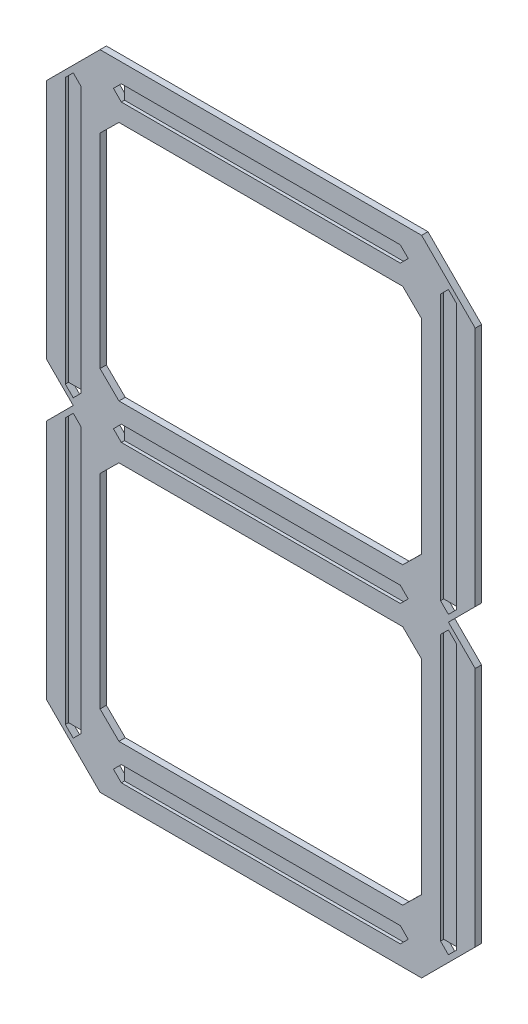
ISO-10303-21;
HEADER;
FILE_DESCRIPTION(('STEP AP214'),'2;1');
FILE_NAME('part.step','',(''),(''),'','','');
FILE_SCHEMA(('AUTOMOTIVE_DESIGN { 1 0 10303 214 1 1 1 1 }'));
ENDSEC;
DATA;
#1=APPLICATION_CONTEXT('core data for automotive mechanical design processes');
#2=APPLICATION_PROTOCOL_DEFINITION('international standard','automotive_design',2000,#1);
#3=PRODUCT_CONTEXT('',#1,'mechanical');
#4=PRODUCT('Part','Part','',(#3));
#5=PRODUCT_RELATED_PRODUCT_CATEGORY('part','',(#4));
#6=PRODUCT_DEFINITION_FORMATION('','',#4);
#7=PRODUCT_DEFINITION_CONTEXT('part definition',#1,'design');
#8=PRODUCT_DEFINITION('design','',#6,#7);
#9=PRODUCT_DEFINITION_SHAPE('','',#8);
#10=(LENGTH_UNIT() NAMED_UNIT(*) SI_UNIT(.MILLI.,.METRE.));
#11=(NAMED_UNIT(*) PLANE_ANGLE_UNIT() SI_UNIT($,.RADIAN.));
#12=(NAMED_UNIT(*) SI_UNIT($,.STERADIAN.) SOLID_ANGLE_UNIT());
#13=UNCERTAINTY_MEASURE_WITH_UNIT(LENGTH_MEASURE(1.E-05),#10,'distance_accuracy_value','');
#14=(GEOMETRIC_REPRESENTATION_CONTEXT(3) GLOBAL_UNCERTAINTY_ASSIGNED_CONTEXT((#13)) GLOBAL_UNIT_ASSIGNED_CONTEXT((#10,
#11,#12)) REPRESENTATION_CONTEXT('',''));
#15=CARTESIAN_POINT('',(0.,0.,0.));
#16=DIRECTION('',(0.,0.,1.));
#17=DIRECTION('',(1.,0.,0.));
#18=AXIS2_PLACEMENT_3D('',#15,#16,#17);
#19=CARTESIAN_POINT('',(0.,0.,-6.));
#20=DIRECTION('',(0.,0.,-1.));
#21=DIRECTION('',(-1.,0.,0.));
#22=AXIS2_PLACEMENT_3D('',#19,#20,#21);
#23=PLANE('',#22);
#24=DIRECTION('',(-0.712377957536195,-0.701796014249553,0.));
#25=VECTOR('',#24,1.);
#26=CARTESIAN_POINT('',(-152.4,-43.0410023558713,-6.));
#27=LINE('',#26,#25);
#28=CARTESIAN_POINT('',(-134.493,-25.4000000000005,-6.));
#29=VERTEX_POINT('',#28);
#30=CARTESIAN_POINT('',(-152.4,-43.0410023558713,-6.));
#31=VERTEX_POINT('',#30);
#32=EDGE_CURVE('E902',#29,#31,#27,.T.);
#33=ORIENTED_EDGE('',*,*,#32,.T.);
#34=DIRECTION('',(0.,-1.,0.));
#35=VECTOR('',#34,1.);
#36=CARTESIAN_POINT('',(-152.399999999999,-236.358997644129,-6.));
#37=LINE('',#36,#35);
#38=CARTESIAN_POINT('',(-152.399999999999,-236.358997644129,-6.));
#39=VERTEX_POINT('',#38);
#40=EDGE_CURVE('E905',#31,#39,#37,.T.);
#41=ORIENTED_EDGE('',*,*,#40,.T.);
#42=DIRECTION('',(0.712377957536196,-0.701796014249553,0.));
#43=VECTOR('',#42,1.);
#44=CARTESIAN_POINT('',(-152.399999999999,-236.358997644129,-6.));
#45=LINE('',#44,#43);
#46=CARTESIAN_POINT('',(-134.493,-253.999999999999,-6.));
#47=VERTEX_POINT('',#46);
#48=EDGE_CURVE('E909',#39,#47,#45,.T.);
#49=ORIENTED_EDGE('',*,*,#48,.T.);
#50=DIRECTION('',(1.,0.,0.));
#51=VECTOR('',#50,1.);
#52=CARTESIAN_POINT('',(134.493000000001,-253.999999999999,-6.));
#53=LINE('',#52,#51);
#54=CARTESIAN_POINT('',(134.493000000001,-253.999999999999,-6.));
#55=VERTEX_POINT('',#54);
#56=EDGE_CURVE('E912',#47,#55,#53,.T.);
#57=ORIENTED_EDGE('',*,*,#56,.T.);
#58=DIRECTION('',(0.712377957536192,0.701796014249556,0.));
#59=VECTOR('',#58,1.);
#60=CARTESIAN_POINT('',(152.4,-236.358997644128,-6.));
#61=LINE('',#60,#59);
#62=CARTESIAN_POINT('',(152.4,-236.358997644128,-6.));
#63=VERTEX_POINT('',#62);
#64=EDGE_CURVE('E915',#55,#63,#61,.T.);
#65=ORIENTED_EDGE('',*,*,#64,.T.);
#66=DIRECTION('',(0.,1.,0.));
#67=VECTOR('',#66,1.);
#68=CARTESIAN_POINT('',(152.399999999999,-43.0410023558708,-6.));
#69=LINE('',#68,#67);
#70=CARTESIAN_POINT('',(152.399999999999,-43.0410023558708,-6.));
#71=VERTEX_POINT('',#70);
#72=EDGE_CURVE('E918',#63,#71,#69,.T.);
#73=ORIENTED_EDGE('',*,*,#72,.T.);
#74=DIRECTION('',(-0.712377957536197,0.701796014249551,0.));
#75=VECTOR('',#74,1.);
#76=CARTESIAN_POINT('',(152.399999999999,-43.0410023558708,-6.));
#77=LINE('',#76,#75);
#78=CARTESIAN_POINT('',(134.493,-25.4000000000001,-6.));
#79=VERTEX_POINT('',#78);
#80=EDGE_CURVE('E921',#71,#79,#77,.T.);
#81=ORIENTED_EDGE('',*,*,#80,.T.);
#82=DIRECTION('',(-1.,0.,0.));
#83=VECTOR('',#82,1.);
#84=CARTESIAN_POINT('',(-134.493,-25.4000000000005,-6.));
#85=LINE('',#84,#83);
#86=EDGE_CURVE('E924',#79,#29,#85,.T.);
#87=ORIENTED_EDGE('',*,*,#86,.T.);
#88=EDGE_LOOP('',(#33,#41,#49,#57,#65,#73,#81,#87));
#89=FACE_BOUND('',#88,.T.);
#90=DIRECTION('',(-0.712377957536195,-0.701796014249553,0.));
#91=VECTOR('',#90,1.);
#92=CARTESIAN_POINT('',(-152.4,236.358997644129,-6.));
#93=LINE('',#92,#91);
#94=CARTESIAN_POINT('',(-134.493,253.999999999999,-6.));
#95=VERTEX_POINT('',#94);
#96=CARTESIAN_POINT('',(-152.4,236.358997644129,-6.));
#97=VERTEX_POINT('',#96);
#98=EDGE_CURVE('E966',#95,#97,#93,.T.);
#99=ORIENTED_EDGE('',*,*,#98,.T.);
#100=DIRECTION('',(0.,-1.,0.));
#101=VECTOR('',#100,1.);
#102=CARTESIAN_POINT('',(-152.4,43.0410023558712,-6.));
#103=LINE('',#102,#101);
#104=CARTESIAN_POINT('',(-152.4,43.0410023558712,-6.));
#105=VERTEX_POINT('',#104);
#106=EDGE_CURVE('E969',#97,#105,#103,.T.);
#107=ORIENTED_EDGE('',*,*,#106,.T.);
#108=DIRECTION('',(0.712377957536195,-0.701796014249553,0.));
#109=VECTOR('',#108,1.);
#110=CARTESIAN_POINT('',(-152.4,43.0410023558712,-6.));
#111=LINE('',#110,#109);
#112=CARTESIAN_POINT('',(-134.493,25.4000000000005,-6.));
#113=VERTEX_POINT('',#112);
#114=EDGE_CURVE('E973',#105,#113,#111,.T.);
#115=ORIENTED_EDGE('',*,*,#114,.T.);
#116=DIRECTION('',(1.,0.,0.));
#117=VECTOR('',#116,1.);
#118=CARTESIAN_POINT('',(134.493,25.4000000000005,-6.));
#119=LINE('',#118,#117);
#120=CARTESIAN_POINT('',(134.493,25.4000000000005,-6.));
#121=VERTEX_POINT('',#120);
#122=EDGE_CURVE('E976',#113,#121,#119,.T.);
#123=ORIENTED_EDGE('',*,*,#122,.T.);
#124=DIRECTION('',(0.712377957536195,0.701796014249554,0.));
#125=VECTOR('',#124,1.);
#126=CARTESIAN_POINT('',(152.399999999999,43.0410023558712,-6.));
#127=LINE('',#126,#125);
#128=CARTESIAN_POINT('',(152.399999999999,43.0410023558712,-6.));
#129=VERTEX_POINT('',#128);
#130=EDGE_CURVE('E979',#121,#129,#127,.T.);
#131=ORIENTED_EDGE('',*,*,#130,.T.);
#132=DIRECTION('',(0.,1.,0.));
#133=VECTOR('',#132,1.);
#134=CARTESIAN_POINT('',(152.4,236.358997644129,-6.));
#135=LINE('',#134,#133);
#136=CARTESIAN_POINT('',(152.4,236.358997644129,-6.));
#137=VERTEX_POINT('',#136);
#138=EDGE_CURVE('E982',#129,#137,#135,.T.);
#139=ORIENTED_EDGE('',*,*,#138,.T.);
#140=DIRECTION('',(-0.712377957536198,0.701796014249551,0.));
#141=VECTOR('',#140,1.);
#142=CARTESIAN_POINT('',(152.4,236.358997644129,-6.));
#143=LINE('',#142,#141);
#144=CARTESIAN_POINT('',(134.493,253.999999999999,-6.));
#145=VERTEX_POINT('',#144);
#146=EDGE_CURVE('E985',#137,#145,#143,.T.);
#147=ORIENTED_EDGE('',*,*,#146,.T.);
#148=DIRECTION('',(-1.,0.,0.));
#149=VECTOR('',#148,1.);
#150=CARTESIAN_POINT('',(-134.493,253.999999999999,-6.));
#151=LINE('',#150,#149);
#152=EDGE_CURVE('E988',#145,#95,#151,.T.);
#153=ORIENTED_EDGE('',*,*,#152,.T.);
#154=EDGE_LOOP('',(#99,#107,#115,#123,#131,#139,#147,#153));
#155=FACE_BOUND('',#154,.T.);
#156=DIRECTION('',(0.707106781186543,0.707106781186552,0.));
#157=VECTOR('',#156,1.);
#158=CARTESIAN_POINT('',(177.8,9.77100086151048E-13,-6.));
#159=LINE('',#158,#157);
#160=CARTESIAN_POINT('',(177.8,9.77100086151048E-13,-6.));
#161=VERTEX_POINT('',#160);
#162=CARTESIAN_POINT('',(203.2,25.4000000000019,-6.));
#163=VERTEX_POINT('',#162);
#164=EDGE_CURVE('E1030',#161,#163,#159,.T.);
#165=ORIENTED_EDGE('',*,*,#164,.F.);
#166=DIRECTION('',(-0.707106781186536,0.707106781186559,0.));
#167=VECTOR('',#166,1.);
#168=CARTESIAN_POINT('',(177.8,9.77100086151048E-13,-6.));
#169=LINE('',#168,#167);
#170=CARTESIAN_POINT('',(203.2,-25.4000000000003,-6.));
#171=VERTEX_POINT('',#170);
#172=EDGE_CURVE('E1070',#171,#161,#169,.T.);
#173=ORIENTED_EDGE('',*,*,#172,.F.);
#174=DIRECTION('',(0.,1.,0.));
#175=VECTOR('',#174,1.);
#176=CARTESIAN_POINT('',(203.2,-253.999999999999,-6.));
#177=LINE('',#176,#175);
#178=CARTESIAN_POINT('',(203.2,-253.999999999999,-6.));
#179=VERTEX_POINT('',#178);
#180=EDGE_CURVE('E1067',#179,#171,#177,.T.);
#181=ORIENTED_EDGE('',*,*,#180,.F.);
#182=DIRECTION('',(0.707106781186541,0.707106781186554,0.));
#183=VECTOR('',#182,1.);
#184=CARTESIAN_POINT('',(152.4,-304.8,-6.));
#185=LINE('',#184,#183);
#186=CARTESIAN_POINT('',(152.4,-304.8,-6.));
#187=VERTEX_POINT('',#186);
#188=EDGE_CURVE('E1064',#187,#179,#185,.T.);
#189=ORIENTED_EDGE('',*,*,#188,.F.);
#190=DIRECTION('',(1.,0.,0.));
#191=VECTOR('',#190,1.);
#192=CARTESIAN_POINT('',(-152.4,-304.8,-6.));
#193=LINE('',#192,#191);
#194=CARTESIAN_POINT('',(-152.4,-304.8,-6.));
#195=VERTEX_POINT('',#194);
#196=EDGE_CURVE('E1061',#195,#187,#193,.T.);
#197=ORIENTED_EDGE('',*,*,#196,.F.);
#198=DIRECTION('',(0.707106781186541,-0.707106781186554,0.));
#199=VECTOR('',#198,1.);
#200=CARTESIAN_POINT('',(-152.4,-304.8,-6.));
#201=LINE('',#200,#199);
#202=CARTESIAN_POINT('',(-203.2,-253.999999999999,-6.));
#203=VERTEX_POINT('',#202);
#204=EDGE_CURVE('E1058',#203,#195,#201,.T.);
#205=ORIENTED_EDGE('',*,*,#204,.F.);
#206=DIRECTION('',(0.,-1.,0.));
#207=VECTOR('',#206,1.);
#208=CARTESIAN_POINT('',(-203.2,-25.4000000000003,-6.));
#209=LINE('',#208,#207);
#210=CARTESIAN_POINT('',(-203.2,-25.4000000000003,-6.));
#211=VERTEX_POINT('',#210);
#212=EDGE_CURVE('E1055',#211,#203,#209,.T.);
#213=ORIENTED_EDGE('',*,*,#212,.F.);
#214=DIRECTION('',(-0.707106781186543,-0.707106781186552,0.));
#215=VECTOR('',#214,1.);
#216=CARTESIAN_POINT('',(-177.8,0.,-6.));
#217=LINE('',#216,#215);
#218=CARTESIAN_POINT('',(-177.8,0.,-6.));
#219=VERTEX_POINT('',#218);
#220=EDGE_CURVE('E1052',#219,#211,#217,.T.);
#221=ORIENTED_EDGE('',*,*,#220,.F.);
#222=DIRECTION('',(0.70710678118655,-0.707106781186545,0.));
#223=VECTOR('',#222,1.);
#224=CARTESIAN_POINT('',(-177.8,0.,-6.));
#225=LINE('',#224,#223);
#226=CARTESIAN_POINT('',(-203.2,25.3999999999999,-6.));
#227=VERTEX_POINT('',#226);
#228=EDGE_CURVE('E1049',#227,#219,#225,.T.);
#229=ORIENTED_EDGE('',*,*,#228,.F.);
#230=DIRECTION('',(0.,-1.,0.));
#231=VECTOR('',#230,1.);
#232=CARTESIAN_POINT('',(-203.2,25.3999999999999,-6.));
#233=LINE('',#232,#231);
#234=CARTESIAN_POINT('',(-203.2,253.999999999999,-6.));
#235=VERTEX_POINT('',#234);
#236=EDGE_CURVE('E1046',#235,#227,#233,.T.);
#237=ORIENTED_EDGE('',*,*,#236,.F.);
#238=DIRECTION('',(-0.707106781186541,-0.707106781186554,0.));
#239=VECTOR('',#238,1.);
#240=CARTESIAN_POINT('',(-152.4,304.8,-6.));
#241=LINE('',#240,#239);
#242=CARTESIAN_POINT('',(-152.4,304.8,-6.));
#243=VERTEX_POINT('',#242);
#244=EDGE_CURVE('E1043',#243,#235,#241,.T.);
#245=ORIENTED_EDGE('',*,*,#244,.F.);
#246=DIRECTION('',(-1.,0.,0.));
#247=VECTOR('',#246,1.);
#248=CARTESIAN_POINT('',(152.399999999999,304.8,-6.));
#249=LINE('',#248,#247);
#250=CARTESIAN_POINT('',(152.399999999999,304.8,-6.));
#251=VERTEX_POINT('',#250);
#252=EDGE_CURVE('E1040',#251,#243,#249,.T.);
#253=ORIENTED_EDGE('',*,*,#252,.F.);
#254=DIRECTION('',(-0.707106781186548,0.707106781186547,0.));
#255=VECTOR('',#254,1.);
#256=CARTESIAN_POINT('',(152.399999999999,304.8,-6.));
#257=LINE('',#256,#255);
#258=CARTESIAN_POINT('',(203.2,253.999999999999,-6.));
#259=VERTEX_POINT('',#258);
#260=EDGE_CURVE('E1037',#259,#251,#257,.T.);
#261=ORIENTED_EDGE('',*,*,#260,.F.);
#262=DIRECTION('',(0.,1.,0.));
#263=VECTOR('',#262,1.);
#264=CARTESIAN_POINT('',(203.2,25.4000000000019,-6.));
#265=LINE('',#264,#263);
#266=EDGE_CURVE('E1033',#163,#259,#265,.T.);
#267=ORIENTED_EDGE('',*,*,#266,.F.);
#268=EDGE_LOOP('',(#165,#173,#181,#189,#197,#205,#213,#221,#229,#237,#245,#253,#261,#267));
#269=FACE_BOUND('',#268,.T.);
#270=DIRECTION('',(-1.,0.,0.));
#271=VECTOR('',#270,1.);
#272=CARTESIAN_POINT('',(0.,13.8499999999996,-6.));
#273=LINE('',#272,#271);
#274=CARTESIAN_POINT('',(-170.299999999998,13.8499999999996,-6.00000000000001));
#275=VERTEX_POINT('',#274);
#276=CARTESIAN_POINT('',(-185.299999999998,13.8499999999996,-6.));
#277=VERTEX_POINT('',#276);
#278=EDGE_CURVE('E600',#275,#277,#273,.T.);
#279=ORIENTED_EDGE('',*,*,#278,.T.);
#280=DIRECTION('',(0.707106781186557,-0.707106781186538,0.));
#281=VECTOR('',#280,1.);
#282=CARTESIAN_POINT('',(-85.7249999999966,-85.7249999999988,-6.));
#283=LINE('',#282,#281);
#284=CARTESIAN_POINT('',(-177.799999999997,6.34999999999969,-6.00000000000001));
#285=VERTEX_POINT('',#284);
#286=EDGE_CURVE('E606',#277,#285,#283,.T.);
#287=ORIENTED_EDGE('',*,*,#286,.T.);
#288=DIRECTION('',(0.707106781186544,0.707106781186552,0.));
#289=VECTOR('',#288,1.);
#290=CARTESIAN_POINT('',(-92.0749999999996,92.0749999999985,-6.));
#291=LINE('',#290,#289);
#292=EDGE_CURVE('E603',#285,#275,#291,.T.);
#293=ORIENTED_EDGE('',*,*,#292,.T.);
#294=EDGE_LOOP('',(#279,#287,#293));
#295=FACE_BOUND('',#294,.T.);
#296=DIRECTION('',(0.,1.,0.));
#297=VECTOR('',#296,1.);
#298=CARTESIAN_POINT('',(-132.200000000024,1.2230956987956E-12,-6.));
#299=LINE('',#298,#297);
#300=CARTESIAN_POINT('',(-132.200000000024,-7.50000000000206,-6.00000000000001));
#301=VERTEX_POINT('',#300);
#302=CARTESIAN_POINT('',(-132.200000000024,7.49999999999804,-6.));
#303=VERTEX_POINT('',#302);
#304=EDGE_CURVE('E523',#301,#303,#299,.T.);
#305=ORIENTED_EDGE('',*,*,#304,.T.);
#306=DIRECTION('',(-0.707106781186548,-0.707106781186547,0.));
#307=VECTOR('',#306,1.);
#308=CARTESIAN_POINT('',(-69.8500000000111,69.8500000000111,-6.));
#309=LINE('',#308,#307);
#310=CARTESIAN_POINT('',(-139.700000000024,-2.0759381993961E-12,-6.00000000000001));
#311=VERTEX_POINT('',#310);
#312=EDGE_CURVE('E545',#303,#311,#309,.T.);
#313=ORIENTED_EDGE('',*,*,#312,.T.);
#314=DIRECTION('',(0.707106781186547,-0.707106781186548,0.));
#315=VECTOR('',#314,1.);
#316=CARTESIAN_POINT('',(-69.8500000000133,-69.8500000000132,-6.));
#317=LINE('',#316,#315);
#318=EDGE_CURVE('E534',#311,#301,#317,.T.);
#319=ORIENTED_EDGE('',*,*,#318,.T.);
#320=EDGE_LOOP('',(#305,#313,#319));
#321=FACE_BOUND('',#320,.T.);
#322=DIRECTION('',(-1.,0.,0.));
#323=VECTOR('',#322,1.);
#324=CARTESIAN_POINT('',(-4.91366206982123E-12,-265.550000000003,-6.));
#325=LINE('',#324,#323);
#326=CARTESIAN_POINT('',(-170.300000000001,-265.55,-6.00000000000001));
#327=VERTEX_POINT('',#326);
#328=CARTESIAN_POINT('',(-185.299999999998,-265.55,-6.));
#329=VERTEX_POINT('',#328);
#330=EDGE_CURVE('E547',#327,#329,#325,.T.);
#331=ORIENTED_EDGE('',*,*,#330,.T.);
#332=DIRECTION('',(0.707106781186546,-0.707106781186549,0.));
#333=VECTOR('',#332,1.);
#334=CARTESIAN_POINT('',(-225.424999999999,-225.424999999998,-6.));
#335=LINE('',#334,#333);
#336=CARTESIAN_POINT('',(-177.799999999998,-273.05,-6.00000000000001));
#337=VERTEX_POINT('',#336);
#338=EDGE_CURVE('E556',#329,#337,#335,.T.);
#339=ORIENTED_EDGE('',*,*,#338,.T.);
#340=DIRECTION('',(0.707106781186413,0.707106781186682,0.));
#341=VECTOR('',#340,1.);
#342=CARTESIAN_POINT('',(47.6249999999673,-47.6249999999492,-6.));
#343=LINE('',#342,#341);
#344=EDGE_CURVE('E553',#337,#327,#343,.T.);
#345=ORIENTED_EDGE('',*,*,#344,.T.);
#346=EDGE_LOOP('',(#331,#339,#345));
#347=FACE_BOUND('',#346,.T.);
#348=DIRECTION('',(0.,1.,0.));
#349=VECTOR('',#348,1.);
#350=CARTESIAN_POINT('',(-132.200000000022,1.7123339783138E-12,-6.));
#351=LINE('',#350,#349);
#352=CARTESIAN_POINT('',(-132.200000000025,-286.900000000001,-6.00000000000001));
#353=VERTEX_POINT('',#352);
#354=CARTESIAN_POINT('',(-132.200000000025,-271.900000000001,-6.));
#355=VERTEX_POINT('',#354);
#356=EDGE_CURVE('E559',#353,#355,#351,.T.);
#357=ORIENTED_EDGE('',*,*,#356,.T.);
#358=DIRECTION('',(-0.707106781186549,-0.707106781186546,0.));
#359=VECTOR('',#358,1.);
#360=CARTESIAN_POINT('',(69.8499999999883,-69.8499999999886,-6.));
#361=LINE('',#360,#359);
#362=CARTESIAN_POINT('',(-139.700000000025,-279.400000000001,-6.00000000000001));
#363=VERTEX_POINT('',#362);
#364=EDGE_CURVE('E565',#355,#363,#361,.T.);
#365=ORIENTED_EDGE('',*,*,#364,.T.);
#366=DIRECTION('',(0.707106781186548,-0.707106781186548,0.));
#367=VECTOR('',#366,1.);
#368=CARTESIAN_POINT('',(-209.550000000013,-209.550000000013,-6.));
#369=LINE('',#368,#367);
#370=EDGE_CURVE('E562',#363,#353,#369,.T.);
#371=ORIENTED_EDGE('',*,*,#370,.T.);
#372=EDGE_LOOP('',(#357,#365,#371));
#373=FACE_BOUND('',#372,.T.);
#374=DIRECTION('',(-1.,0.,0.));
#375=VECTOR('',#374,1.);
#376=CARTESIAN_POINT('',(2.94819724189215E-12,-265.550000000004,-6.));
#377=LINE('',#376,#375);
#378=CARTESIAN_POINT('',(185.299999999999,-265.550000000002,-6.00000000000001));
#379=VERTEX_POINT('',#378);
#380=CARTESIAN_POINT('',(170.299999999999,-265.550000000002,-6.));
#381=VERTEX_POINT('',#380);
#382=EDGE_CURVE('E586',#379,#381,#377,.T.);
#383=ORIENTED_EDGE('',*,*,#382,.T.);
#384=DIRECTION('',(0.70710678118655,-0.707106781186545,0.));
#385=VECTOR('',#384,1.);
#386=CARTESIAN_POINT('',(-47.6250000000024,-47.6250000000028,-6.));
#387=LINE('',#386,#385);
#388=CARTESIAN_POINT('',(177.799999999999,-273.050000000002,-6.00000000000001));
#389=VERTEX_POINT('',#388);
#390=EDGE_CURVE('E592',#381,#389,#387,.T.);
#391=ORIENTED_EDGE('',*,*,#390,.T.);
#392=DIRECTION('',(0.707106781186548,0.707106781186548,0.));
#393=VECTOR('',#392,1.);
#394=CARTESIAN_POINT('',(225.425,-225.425,-6.));
#395=LINE('',#394,#393);
#396=EDGE_CURVE('E589',#389,#379,#395,.T.);
#397=ORIENTED_EDGE('',*,*,#396,.T.);
#398=EDGE_LOOP('',(#383,#391,#397));
#399=FACE_BOUND('',#398,.T.);
#400=DIRECTION('',(-1.,0.,0.));
#401=VECTOR('',#400,1.);
#402=CARTESIAN_POINT('',(-1.02510592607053E-13,13.8499999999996,-6.));
#403=LINE('',#402,#401);
#404=CARTESIAN_POINT('',(185.299999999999,13.850000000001,-6.00000000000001));
#405=VERTEX_POINT('',#404);
#406=CARTESIAN_POINT('',(170.299999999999,13.8500000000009,-6.));
#407=VERTEX_POINT('',#406);
#408=EDGE_CURVE('E577',#405,#407,#403,.T.);
#409=ORIENTED_EDGE('',*,*,#408,.T.);
#410=DIRECTION('',(0.707106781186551,-0.707106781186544,0.));
#411=VECTOR('',#410,1.);
#412=CARTESIAN_POINT('',(92.074999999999,92.075,-6.));
#413=LINE('',#412,#411);
#414=CARTESIAN_POINT('',(177.799999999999,6.35000000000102,-6.00000000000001));
#415=VERTEX_POINT('',#414);
#416=EDGE_CURVE('E583',#407,#415,#413,.T.);
#417=ORIENTED_EDGE('',*,*,#416,.T.);
#418=DIRECTION('',(0.707106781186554,0.707106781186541,0.));
#419=VECTOR('',#418,1.);
#420=CARTESIAN_POINT('',(85.7249999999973,-85.7249999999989,-6.));
#421=LINE('',#420,#419);
#422=EDGE_CURVE('E580',#415,#405,#421,.T.);
#423=ORIENTED_EDGE('',*,*,#422,.T.);
#424=EDGE_LOOP('',(#409,#417,#423));
#425=FACE_BOUND('',#424,.T.);
#426=DIRECTION('',(0.,1.,0.));
#427=VECTOR('',#426,1.);
#428=CARTESIAN_POINT('',(-132.200000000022,-1.22309569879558E-12,-6.));
#429=LINE('',#428,#427);
#430=CARTESIAN_POINT('',(-132.200000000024,271.900000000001,-6.00000000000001));
#431=VERTEX_POINT('',#430);
#432=CARTESIAN_POINT('',(-132.200000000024,286.900000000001,-6.));
#433=VERTEX_POINT('',#432);
#434=EDGE_CURVE('E568',#431,#433,#429,.T.);
#435=ORIENTED_EDGE('',*,*,#434,.T.);
#436=DIRECTION('',(-0.707106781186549,-0.707106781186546,0.));
#437=VECTOR('',#436,1.);
#438=CARTESIAN_POINT('',(-209.550000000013,209.550000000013,-6.));
#439=LINE('',#438,#437);
#440=CARTESIAN_POINT('',(-139.700000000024,279.400000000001,-6.00000000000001));
#441=VERTEX_POINT('',#440);
#442=EDGE_CURVE('E574',#433,#441,#439,.T.);
#443=ORIENTED_EDGE('',*,*,#442,.T.);
#444=DIRECTION('',(0.707106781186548,-0.707106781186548,0.));
#445=VECTOR('',#444,1.);
#446=CARTESIAN_POINT('',(69.8499999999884,69.8499999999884,-6.));
#447=LINE('',#446,#445);
#448=EDGE_CURVE('E571',#441,#431,#447,.T.);
#449=ORIENTED_EDGE('',*,*,#448,.T.);
#450=EDGE_LOOP('',(#435,#443,#449));
#451=FACE_BOUND('',#450,.T.);
#452=ADVANCED_FACE('F33',(#89,#155,#269,#295,#321,#347,#373,#399,#425,#451),#23,.T.);
#453=CARTESIAN_POINT('',(0.,0.,-3.));
#454=DIRECTION('',(0.,0.,1.));
#455=DIRECTION('',(1.,0.,0.));
#456=AXIS2_PLACEMENT_3D('',#453,#454,#455);
#457=PLANE('',#456);
#458=DIRECTION('',(0.,-1.,0.));
#459=VECTOR('',#458,1.);
#460=CARTESIAN_POINT('',(170.299999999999,-265.550000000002,-3.));
#461=LINE('',#460,#459);
#462=CARTESIAN_POINT('',(170.299999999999,-13.8500000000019,-3.));
#463=VERTEX_POINT('',#462);
#464=CARTESIAN_POINT('',(170.299999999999,-265.550000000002,-3.));
#465=VERTEX_POINT('',#464);
#466=EDGE_CURVE('E867',#463,#465,#461,.T.);
#467=ORIENTED_EDGE('',*,*,#466,.T.);
#468=DIRECTION('',(1.,0.,0.));
#469=VECTOR('',#468,1.);
#470=CARTESIAN_POINT('',(2.94819724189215E-12,-265.550000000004,-3.));
#471=LINE('',#470,#469);
#472=CARTESIAN_POINT('',(185.299999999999,-265.550000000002,-3.));
#473=VERTEX_POINT('',#472);
#474=EDGE_CURVE('E11',#465,#473,#471,.T.);
#475=ORIENTED_EDGE('',*,*,#474,.T.);
#476=DIRECTION('',(0.,1.,0.));
#477=VECTOR('',#476,1.);
#478=CARTESIAN_POINT('',(185.299999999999,-13.8500000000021,-3.));
#479=LINE('',#478,#477);
#480=CARTESIAN_POINT('',(185.299999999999,-13.8500000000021,-3.));
#481=VERTEX_POINT('',#480);
#482=EDGE_CURVE('E870',#473,#481,#479,.T.);
#483=ORIENTED_EDGE('',*,*,#482,.T.);
#484=DIRECTION('',(-0.707106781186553,0.707106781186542,0.));
#485=VECTOR('',#484,1.);
#486=CARTESIAN_POINT('',(177.799999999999,-6.3500000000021,-3.));
#487=LINE('',#486,#485);
#488=CARTESIAN_POINT('',(177.799999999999,-6.3500000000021,-3.));
#489=VERTEX_POINT('',#488);
#490=EDGE_CURVE('E860',#481,#489,#487,.T.);
#491=ORIENTED_EDGE('',*,*,#490,.T.);
#492=DIRECTION('',(-0.707106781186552,-0.707106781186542,0.));
#493=VECTOR('',#492,1.);
#494=CARTESIAN_POINT('',(177.799999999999,-6.3500000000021,-3.));
#495=LINE('',#494,#493);
#496=EDGE_CURVE('E863',#489,#463,#495,.T.);
#497=ORIENTED_EDGE('',*,*,#496,.T.);
#498=EDGE_LOOP('',(#467,#475,#483,#491,#497));
#499=FACE_BOUND('',#498,.T.);
#500=ADVANCED_FACE('F1186',(#499),#457,.T.);
#501=CARTESIAN_POINT('',(0.,0.,-3.));
#502=DIRECTION('',(0.,0.,-1.));
#503=DIRECTION('',(-1.,0.,0.));
#504=AXIS2_PLACEMENT_3D('',#501,#502,#503);
#505=PLANE('',#504);
#506=DIRECTION('',(-1.,0.,0.));
#507=VECTOR('',#506,1.);
#508=CARTESIAN_POINT('',(-1.02510592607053E-13,13.8499999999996,-3.));
#509=LINE('',#508,#507);
#510=CARTESIAN_POINT('',(185.299999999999,13.850000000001,-3.));
#511=VERTEX_POINT('',#510);
#512=CARTESIAN_POINT('',(170.299999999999,13.8500000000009,-3.));
#513=VERTEX_POINT('',#512);
#514=EDGE_CURVE('E41',#511,#513,#509,.T.);
#515=ORIENTED_EDGE('',*,*,#514,.F.);
#516=DIRECTION('',(0.,1.,0.));
#517=VECTOR('',#516,1.);
#518=CARTESIAN_POINT('',(185.299999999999,13.850000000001,-3.));
#519=LINE('',#518,#517);
#520=CARTESIAN_POINT('',(185.3,265.550000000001,-3.));
#521=VERTEX_POINT('',#520);
#522=EDGE_CURVE('E734',#511,#521,#519,.T.);
#523=ORIENTED_EDGE('',*,*,#522,.T.);
#524=DIRECTION('',(-0.707106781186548,0.707106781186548,0.));
#525=VECTOR('',#524,1.);
#526=CARTESIAN_POINT('',(177.799999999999,273.050000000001,-3.));
#527=LINE('',#526,#525);
#528=CARTESIAN_POINT('',(177.799999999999,273.050000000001,-3.));
#529=VERTEX_POINT('',#528);
#530=EDGE_CURVE('E737',#521,#529,#527,.T.);
#531=ORIENTED_EDGE('',*,*,#530,.T.);
#532=DIRECTION('',(-0.70710678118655,-0.707106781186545,0.));
#533=VECTOR('',#532,1.);
#534=CARTESIAN_POINT('',(177.799999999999,273.050000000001,-3.));
#535=LINE('',#534,#533);
#536=CARTESIAN_POINT('',(170.3,265.550000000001,-3.));
#537=VERTEX_POINT('',#536);
#538=EDGE_CURVE('E741',#529,#537,#535,.T.);
#539=ORIENTED_EDGE('',*,*,#538,.T.);
#540=DIRECTION('',(0.,-1.,0.));
#541=VECTOR('',#540,1.);
#542=CARTESIAN_POINT('',(170.3,265.550000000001,-3.));
#543=LINE('',#542,#541);
#544=EDGE_CURVE('E744',#537,#513,#543,.T.);
#545=ORIENTED_EDGE('',*,*,#544,.T.);
#546=EDGE_LOOP('',(#515,#523,#531,#539,#545));
#547=FACE_BOUND('',#546,.T.);
#548=ADVANCED_FACE('F1168',(#547),#505,.F.);
#549=CARTESIAN_POINT('',(0.,0.,-3.));
#550=DIRECTION('',(0.,0.,-1.));
#551=DIRECTION('',(-1.,0.,0.));
#552=AXIS2_PLACEMENT_3D('',#549,#550,#551);
#553=PLANE('',#552);
#554=DIRECTION('',(0.,1.,0.));
#555=VECTOR('',#554,1.);
#556=CARTESIAN_POINT('',(-132.200000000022,-1.22309569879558E-12,-3.));
#557=LINE('',#556,#555);
#558=CARTESIAN_POINT('',(-132.200000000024,271.900000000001,-3.));
#559=VERTEX_POINT('',#558);
#560=CARTESIAN_POINT('',(-132.200000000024,286.900000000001,-3.));
#561=VERTEX_POINT('',#560);
#562=EDGE_CURVE('E1151',#559,#561,#557,.T.);
#563=ORIENTED_EDGE('',*,*,#562,.F.);
#564=DIRECTION('',(1.,0.,0.));
#565=VECTOR('',#564,1.);
#566=CARTESIAN_POINT('',(132.200000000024,271.900000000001,-3.));
#567=LINE('',#566,#565);
#568=CARTESIAN_POINT('',(132.200000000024,271.900000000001,-3.));
#569=VERTEX_POINT('',#568);
#570=EDGE_CURVE('E778',#559,#569,#567,.T.);
#571=ORIENTED_EDGE('',*,*,#570,.T.);
#572=DIRECTION('',(0.707106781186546,0.707106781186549,0.));
#573=VECTOR('',#572,1.);
#574=CARTESIAN_POINT('',(139.699999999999,279.399999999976,-3.));
#575=LINE('',#574,#573);
#576=CARTESIAN_POINT('',(139.699999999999,279.399999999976,-3.));
#577=VERTEX_POINT('',#576);
#578=EDGE_CURVE('E781',#569,#577,#575,.T.);
#579=ORIENTED_EDGE('',*,*,#578,.T.);
#580=DIRECTION('',(-0.707106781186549,0.707106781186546,0.));
#581=VECTOR('',#580,1.);
#582=CARTESIAN_POINT('',(139.699999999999,279.399999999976,-3.));
#583=LINE('',#582,#581);
#584=CARTESIAN_POINT('',(132.199999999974,286.900000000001,-3.));
#585=VERTEX_POINT('',#584);
#586=EDGE_CURVE('E785',#577,#585,#583,.T.);
#587=ORIENTED_EDGE('',*,*,#586,.T.);
#588=DIRECTION('',(-1.,0.,0.));
#589=VECTOR('',#588,1.);
#590=CARTESIAN_POINT('',(-132.200000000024,286.900000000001,-3.));
#591=LINE('',#590,#589);
#592=EDGE_CURVE('E788',#585,#561,#591,.T.);
#593=ORIENTED_EDGE('',*,*,#592,.T.);
#594=EDGE_LOOP('',(#563,#571,#579,#587,#593));
#595=FACE_BOUND('',#594,.T.);
#596=ADVANCED_FACE('F1288',(#595),#553,.F.);
#597=CARTESIAN_POINT('',(0.,0.,-3.));
#598=DIRECTION('',(0.,0.,1.));
#599=DIRECTION('',(1.,0.,0.));
#600=AXIS2_PLACEMENT_3D('',#597,#598,#599);
#601=PLANE('',#600);
#602=DIRECTION('',(-1.,0.,0.));
#603=VECTOR('',#602,1.);
#604=CARTESIAN_POINT('',(132.200000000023,-271.900000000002,-3.));
#605=LINE('',#604,#603);
#606=CARTESIAN_POINT('',(132.200000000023,-271.900000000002,-3.));
#607=VERTEX_POINT('',#606);
#608=CARTESIAN_POINT('',(-132.200000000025,-271.900000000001,-3.));
#609=VERTEX_POINT('',#608);
#610=EDGE_CURVE('E661',#607,#609,#605,.T.);
#611=ORIENTED_EDGE('',*,*,#610,.T.);
#612=DIRECTION('',(0.,-1.,0.));
#613=VECTOR('',#612,1.);
#614=CARTESIAN_POINT('',(-132.200000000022,1.7123339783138E-12,-3.));
#615=LINE('',#614,#613);
#616=CARTESIAN_POINT('',(-132.200000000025,-286.900000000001,-3.));
#617=VERTEX_POINT('',#616);
#618=EDGE_CURVE('E1148',#609,#617,#615,.T.);
#619=ORIENTED_EDGE('',*,*,#618,.T.);
#620=DIRECTION('',(1.,0.,0.));
#621=VECTOR('',#620,1.);
#622=CARTESIAN_POINT('',(-132.200000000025,-286.900000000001,-3.));
#623=LINE('',#622,#621);
#624=CARTESIAN_POINT('',(132.199999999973,-286.900000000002,-3.));
#625=VERTEX_POINT('',#624);
#626=EDGE_CURVE('E664',#617,#625,#623,.T.);
#627=ORIENTED_EDGE('',*,*,#626,.T.);
#628=DIRECTION('',(0.707106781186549,0.707106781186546,0.));
#629=VECTOR('',#628,1.);
#630=CARTESIAN_POINT('',(139.699999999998,-279.399999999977,-3.));
#631=LINE('',#630,#629);
#632=CARTESIAN_POINT('',(139.699999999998,-279.399999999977,-3.));
#633=VERTEX_POINT('',#632);
#634=EDGE_CURVE('E654',#625,#633,#631,.T.);
#635=ORIENTED_EDGE('',*,*,#634,.T.);
#636=DIRECTION('',(-0.707106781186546,0.707106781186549,0.));
#637=VECTOR('',#636,1.);
#638=CARTESIAN_POINT('',(139.699999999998,-279.399999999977,-3.));
#639=LINE('',#638,#637);
#640=EDGE_CURVE('E657',#633,#607,#639,.T.);
#641=ORIENTED_EDGE('',*,*,#640,.T.);
#642=EDGE_LOOP('',(#611,#619,#627,#635,#641));
#643=FACE_BOUND('',#642,.T.);
#644=ADVANCED_FACE('F1235',(#643),#601,.T.);
#645=CARTESIAN_POINT('',(0.,0.,-3.));
#646=DIRECTION('',(0.,0.,-1.));
#647=DIRECTION('',(-1.,0.,0.));
#648=AXIS2_PLACEMENT_3D('',#645,#646,#647);
#649=PLANE('',#648);
#650=DIRECTION('',(-1.,0.,0.));
#651=VECTOR('',#650,1.);
#652=CARTESIAN_POINT('',(-4.91366206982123E-12,-265.550000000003,-3.));
#653=LINE('',#652,#651);
#654=CARTESIAN_POINT('',(-170.300000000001,-265.55,-3.));
#655=VERTEX_POINT('',#654);
#656=CARTESIAN_POINT('',(-185.299999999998,-265.55,-3.));
#657=VERTEX_POINT('',#656);
#658=EDGE_CURVE('E1146',#655,#657,#653,.T.);
#659=ORIENTED_EDGE('',*,*,#658,.F.);
#660=DIRECTION('',(0.,1.,0.));
#661=VECTOR('',#660,1.);
#662=CARTESIAN_POINT('',(-170.300000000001,-265.55,-3.));
#663=LINE('',#662,#661);
#664=CARTESIAN_POINT('',(-170.299999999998,-13.8499999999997,-3.));
#665=VERTEX_POINT('',#664);
#666=EDGE_CURVE('E617',#655,#665,#663,.T.);
#667=ORIENTED_EDGE('',*,*,#666,.T.);
#668=DIRECTION('',(-0.707106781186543,0.707106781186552,0.));
#669=VECTOR('',#668,1.);
#670=CARTESIAN_POINT('',(-177.799999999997,-6.34999999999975,-3.));
#671=LINE('',#670,#669);
#672=CARTESIAN_POINT('',(-177.799999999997,-6.34999999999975,-3.));
#673=VERTEX_POINT('',#672);
#674=EDGE_CURVE('E620',#665,#673,#671,.T.);
#675=ORIENTED_EDGE('',*,*,#674,.T.);
#676=DIRECTION('',(-0.707106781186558,-0.707106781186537,0.));
#677=VECTOR('',#676,1.);
#678=CARTESIAN_POINT('',(-177.799999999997,-6.34999999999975,-3.));
#679=LINE('',#678,#677);
#680=CARTESIAN_POINT('',(-185.299999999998,-13.8499999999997,-3.));
#681=VERTEX_POINT('',#680);
#682=EDGE_CURVE('E610',#673,#681,#679,.T.);
#683=ORIENTED_EDGE('',*,*,#682,.T.);
#684=DIRECTION('',(0.,-1.,0.));
#685=VECTOR('',#684,1.);
#686=CARTESIAN_POINT('',(-185.299999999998,-13.8499999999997,-3.));
#687=LINE('',#686,#685);
#688=EDGE_CURVE('E613',#681,#657,#687,.T.);
#689=ORIENTED_EDGE('',*,*,#688,.T.);
#690=EDGE_LOOP('',(#659,#667,#675,#683,#689));
#691=FACE_BOUND('',#690,.T.);
#692=ADVANCED_FACE('F1255',(#691),#649,.F.);
#693=CARTESIAN_POINT('',(0.,0.,-3.));
#694=DIRECTION('',(0.,0.,1.));
#695=DIRECTION('',(1.,0.,0.));
#696=AXIS2_PLACEMENT_3D('',#693,#694,#695);
#697=PLANE('',#696);
#698=DIRECTION('',(-1.,0.,0.));
#699=VECTOR('',#698,1.);
#700=CARTESIAN_POINT('',(132.200000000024,7.49999999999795,-3.));
#701=LINE('',#700,#699);
#702=CARTESIAN_POINT('',(132.200000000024,7.49999999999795,-3.));
#703=VERTEX_POINT('',#702);
#704=CARTESIAN_POINT('',(-132.200000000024,7.49999999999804,-3.));
#705=VERTEX_POINT('',#704);
#706=EDGE_CURVE('E701',#703,#705,#701,.T.);
#707=ORIENTED_EDGE('',*,*,#706,.T.);
#708=DIRECTION('',(0.,-1.,0.));
#709=VECTOR('',#708,1.);
#710=CARTESIAN_POINT('',(-132.200000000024,1.2230956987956E-12,-3.));
#711=LINE('',#710,#709);
#712=CARTESIAN_POINT('',(-132.200000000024,-7.50000000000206,-3.));
#713=VERTEX_POINT('',#712);
#714=EDGE_CURVE('E1144',#705,#713,#711,.T.);
#715=ORIENTED_EDGE('',*,*,#714,.T.);
#716=DIRECTION('',(1.,0.,0.));
#717=VECTOR('',#716,1.);
#718=CARTESIAN_POINT('',(-132.200000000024,-7.50000000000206,-3.));
#719=LINE('',#718,#717);
#720=CARTESIAN_POINT('',(132.199999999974,-7.50000000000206,-3.));
#721=VERTEX_POINT('',#720);
#722=EDGE_CURVE('E704',#713,#721,#719,.T.);
#723=ORIENTED_EDGE('',*,*,#722,.T.);
#724=DIRECTION('',(0.707106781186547,0.707106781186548,0.));
#725=VECTOR('',#724,1.);
#726=CARTESIAN_POINT('',(139.699999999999,2.29627820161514E-11,-3.));
#727=LINE('',#726,#725);
#728=CARTESIAN_POINT('',(139.699999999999,2.29627820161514E-11,-3.));
#729=VERTEX_POINT('',#728);
#730=EDGE_CURVE('E694',#721,#729,#727,.T.);
#731=ORIENTED_EDGE('',*,*,#730,.T.);
#732=DIRECTION('',(-0.707106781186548,0.707106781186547,0.));
#733=VECTOR('',#732,1.);
#734=CARTESIAN_POINT('',(139.699999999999,2.29627820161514E-11,-3.));
#735=LINE('',#734,#733);
#736=EDGE_CURVE('E697',#729,#703,#735,.T.);
#737=ORIENTED_EDGE('',*,*,#736,.T.);
#738=EDGE_LOOP('',(#707,#715,#723,#731,#737));
#739=FACE_BOUND('',#738,.T.);
#740=ADVANCED_FACE('F1258',(#739),#697,.T.);
#741=CARTESIAN_POINT('',(0.,0.,-3.));
#742=DIRECTION('',(0.,0.,1.));
#743=DIRECTION('',(1.,0.,0.));
#744=AXIS2_PLACEMENT_3D('',#741,#742,#743);
#745=PLANE('',#744);
#746=DIRECTION('',(0.,-1.,0.));
#747=VECTOR('',#746,1.);
#748=CARTESIAN_POINT('',(-185.299999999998,13.8499999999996,-3.));
#749=LINE('',#748,#747);
#750=CARTESIAN_POINT('',(-185.3,265.55,-3.));
#751=VERTEX_POINT('',#750);
#752=CARTESIAN_POINT('',(-185.299999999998,13.8499999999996,-3.));
#753=VERTEX_POINT('',#752);
#754=EDGE_CURVE('E827',#751,#753,#749,.T.);
#755=ORIENTED_EDGE('',*,*,#754,.T.);
#756=DIRECTION('',(1.,0.,0.));
#757=VECTOR('',#756,1.);
#758=CARTESIAN_POINT('',(0.,13.8499999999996,-3.));
#759=LINE('',#758,#757);
#760=CARTESIAN_POINT('',(-170.299999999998,13.8499999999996,-3.));
#761=VERTEX_POINT('',#760);
#762=EDGE_CURVE('E1116',#753,#761,#759,.T.);
#763=ORIENTED_EDGE('',*,*,#762,.T.);
#764=DIRECTION('',(0.,1.,0.));
#765=VECTOR('',#764,1.);
#766=CARTESIAN_POINT('',(-170.3,265.55,-3.));
#767=LINE('',#766,#765);
#768=CARTESIAN_POINT('',(-170.3,265.55,-3.));
#769=VERTEX_POINT('',#768);
#770=EDGE_CURVE('E830',#761,#769,#767,.T.);
#771=ORIENTED_EDGE('',*,*,#770,.T.);
#772=DIRECTION('',(-0.707106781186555,0.70710678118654,0.));
#773=VECTOR('',#772,1.);
#774=CARTESIAN_POINT('',(-177.8,273.05,-3.));
#775=LINE('',#774,#773);
#776=CARTESIAN_POINT('',(-177.8,273.05,-3.));
#777=VERTEX_POINT('',#776);
#778=EDGE_CURVE('E820',#769,#777,#775,.T.);
#779=ORIENTED_EDGE('',*,*,#778,.T.);
#780=DIRECTION('',(-0.707106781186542,-0.707106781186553,0.));
#781=VECTOR('',#780,1.);
#782=CARTESIAN_POINT('',(-177.8,273.05,-3.));
#783=LINE('',#782,#781);
#784=EDGE_CURVE('E823',#777,#751,#783,.T.);
#785=ORIENTED_EDGE('',*,*,#784,.T.);
#786=EDGE_LOOP('',(#755,#763,#771,#779,#785));
#787=FACE_BOUND('',#786,.T.);
#788=ADVANCED_FACE('F1309',(#787),#745,.T.);
#789=CARTESIAN_POINT('',(177.8,9.77100086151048E-13,-6.));
#790=DIRECTION('',(0.707106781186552,-0.707106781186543,0.));
#791=DIRECTION('',(0.707106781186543,0.707106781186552,0.));
#792=AXIS2_PLACEMENT_3D('',#789,#790,#791);
#793=PLANE('',#792);
#794=DIRECTION('',(0.707106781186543,0.707106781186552,0.));
#795=VECTOR('',#794,1.);
#796=CARTESIAN_POINT('',(177.8,9.77100086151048E-13,0.));
#797=LINE('',#796,#795);
#798=CARTESIAN_POINT('',(177.8,9.77100086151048E-13,0.));
#799=VERTEX_POINT('',#798);
#800=CARTESIAN_POINT('',(203.2,25.4000000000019,0.));
#801=VERTEX_POINT('',#800);
#802=EDGE_CURVE('E1015',#799,#801,#797,.T.);
#803=ORIENTED_EDGE('',*,*,#802,.F.);
#804=DIRECTION('',(0.,0.,1.));
#805=VECTOR('',#804,1.);
#806=CARTESIAN_POINT('',(177.8,9.77100086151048E-13,-6.));
#807=LINE('',#806,#805);
#808=EDGE_CURVE('E1114',#161,#799,#807,.T.);
#809=ORIENTED_EDGE('',*,*,#808,.F.);
#810=ORIENTED_EDGE('',*,*,#164,.T.);
#811=DIRECTION('',(0.,0.,1.));
#812=VECTOR('',#811,1.);
#813=CARTESIAN_POINT('',(203.2,25.4000000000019,-6.));
#814=LINE('',#813,#812);
#815=EDGE_CURVE('E1073',#163,#801,#814,.T.);
#816=ORIENTED_EDGE('',*,*,#815,.T.);
#817=EDGE_LOOP('',(#803,#809,#810,#816));
#818=FACE_BOUND('',#817,.T.);
#819=ADVANCED_FACE('F35',(#818),#793,.T.);
#820=CARTESIAN_POINT('',(177.8,9.77100086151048E-13,-6.));
#821=DIRECTION('',(0.707106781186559,0.707106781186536,0.));
#822=DIRECTION('',(-0.707106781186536,0.707106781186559,0.));
#823=AXIS2_PLACEMENT_3D('',#820,#821,#822);
#824=PLANE('',#823);
#825=DIRECTION('',(-0.707106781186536,0.707106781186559,0.));
#826=VECTOR('',#825,1.);
#827=CARTESIAN_POINT('',(177.8,9.77100086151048E-13,0.));
#828=LINE('',#827,#826);
#829=CARTESIAN_POINT('',(203.2,-25.4000000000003,0.));
#830=VERTEX_POINT('',#829);
#831=EDGE_CURVE('E1034',#830,#799,#828,.T.);
#832=ORIENTED_EDGE('',*,*,#831,.F.);
#833=DIRECTION('',(0.,0.,1.));
#834=VECTOR('',#833,1.);
#835=CARTESIAN_POINT('',(203.2,-25.4000000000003,-6.));
#836=LINE('',#835,#834);
#837=EDGE_CURVE('E1117',#171,#830,#836,.T.);
#838=ORIENTED_EDGE('',*,*,#837,.F.);
#839=ORIENTED_EDGE('',*,*,#172,.T.);
#840=ORIENTED_EDGE('',*,*,#808,.T.);
#841=EDGE_LOOP('',(#832,#838,#839,#840));
#842=FACE_BOUND('',#841,.T.);
#843=ADVANCED_FACE('F1495',(#842),#824,.T.);
#844=CARTESIAN_POINT('',(203.2,-253.999999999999,-6.));
#845=DIRECTION('',(1.,0.,0.));
#846=DIRECTION('',(0.,1.,0.));
#847=AXIS2_PLACEMENT_3D('',#844,#845,#846);
#848=PLANE('',#847);
#849=DIRECTION('',(0.,1.,0.));
#850=VECTOR('',#849,1.);
#851=CARTESIAN_POINT('',(203.2,-253.999999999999,0.));
#852=LINE('',#851,#850);
#853=CARTESIAN_POINT('',(203.2,-253.999999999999,0.));
#854=VERTEX_POINT('',#853);
#855=EDGE_CURVE('E1109',#854,#830,#852,.T.);
#856=ORIENTED_EDGE('',*,*,#855,.F.);
#857=DIRECTION('',(0.,0.,1.));
#858=VECTOR('',#857,1.);
#859=CARTESIAN_POINT('',(203.2,-253.999999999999,-6.));
#860=LINE('',#859,#858);
#861=EDGE_CURVE('E1119',#179,#854,#860,.T.);
#862=ORIENTED_EDGE('',*,*,#861,.F.);
#863=ORIENTED_EDGE('',*,*,#180,.T.);
#864=ORIENTED_EDGE('',*,*,#837,.T.);
#865=EDGE_LOOP('',(#856,#862,#863,#864));
#866=FACE_BOUND('',#865,.T.);
#867=ADVANCED_FACE('F1498',(#866),#848,.T.);
#868=CARTESIAN_POINT('',(152.4,-304.8,-6.));
#869=DIRECTION('',(0.707106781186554,-0.707106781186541,0.));
#870=DIRECTION('',(0.707106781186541,0.707106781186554,0.));
#871=AXIS2_PLACEMENT_3D('',#868,#869,#870);
#872=PLANE('',#871);
#873=DIRECTION('',(0.707106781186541,0.707106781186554,0.));
#874=VECTOR('',#873,1.);
#875=CARTESIAN_POINT('',(152.4,-304.8,0.));
#876=LINE('',#875,#874);
#877=CARTESIAN_POINT('',(152.4,-304.8,0.));
#878=VERTEX_POINT('',#877);
#879=EDGE_CURVE('E1106',#878,#854,#876,.T.);
#880=ORIENTED_EDGE('',*,*,#879,.F.);
#881=DIRECTION('',(0.,0.,1.));
#882=VECTOR('',#881,1.);
#883=CARTESIAN_POINT('',(152.4,-304.8,-6.));
#884=LINE('',#883,#882);
#885=EDGE_CURVE('E1121',#187,#878,#884,.T.);
#886=ORIENTED_EDGE('',*,*,#885,.F.);
#887=ORIENTED_EDGE('',*,*,#188,.T.);
#888=ORIENTED_EDGE('',*,*,#861,.T.);
#889=EDGE_LOOP('',(#880,#886,#887,#888));
#890=FACE_BOUND('',#889,.T.);
#891=ADVANCED_FACE('F1502',(#890),#872,.T.);
#892=CARTESIAN_POINT('',(-152.4,-304.8,-6.));
#893=DIRECTION('',(0.,-1.,0.));
#894=DIRECTION('',(0.,0.,-1.));
#895=AXIS2_PLACEMENT_3D('',#892,#893,#894);
#896=PLANE('',#895);
#897=DIRECTION('',(1.,0.,0.));
#898=VECTOR('',#897,1.);
#899=CARTESIAN_POINT('',(-152.4,-304.8,0.));
#900=LINE('',#899,#898);
#901=CARTESIAN_POINT('',(-152.4,-304.8,0.));
#902=VERTEX_POINT('',#901);
#903=EDGE_CURVE('E1103',#902,#878,#900,.T.);
#904=ORIENTED_EDGE('',*,*,#903,.F.);
#905=DIRECTION('',(0.,0.,1.));
#906=VECTOR('',#905,1.);
#907=CARTESIAN_POINT('',(-152.4,-304.8,-6.));
#908=LINE('',#907,#906);
#909=EDGE_CURVE('E1123',#195,#902,#908,.T.);
#910=ORIENTED_EDGE('',*,*,#909,.F.);
#911=ORIENTED_EDGE('',*,*,#196,.T.);
#912=ORIENTED_EDGE('',*,*,#885,.T.);
#913=EDGE_LOOP('',(#904,#910,#911,#912));
#914=FACE_BOUND('',#913,.T.);
#915=ADVANCED_FACE('F1506',(#914),#896,.T.);
#916=CARTESIAN_POINT('',(-152.4,-304.8,-6.));
#917=DIRECTION('',(-0.707106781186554,-0.707106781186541,0.));
#918=DIRECTION('',(0.707106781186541,-0.707106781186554,0.));
#919=AXIS2_PLACEMENT_3D('',#916,#917,#918);
#920=PLANE('',#919);
#921=DIRECTION('',(0.707106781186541,-0.707106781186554,0.));
#922=VECTOR('',#921,1.);
#923=CARTESIAN_POINT('',(-152.4,-304.8,0.));
#924=LINE('',#923,#922);
#925=CARTESIAN_POINT('',(-203.2,-253.999999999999,0.));
#926=VERTEX_POINT('',#925);
#927=EDGE_CURVE('E1100',#926,#902,#924,.T.);
#928=ORIENTED_EDGE('',*,*,#927,.F.);
#929=DIRECTION('',(0.,0.,1.));
#930=VECTOR('',#929,1.);
#931=CARTESIAN_POINT('',(-203.2,-253.999999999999,-6.));
#932=LINE('',#931,#930);
#933=EDGE_CURVE('E1125',#203,#926,#932,.T.);
#934=ORIENTED_EDGE('',*,*,#933,.F.);
#935=ORIENTED_EDGE('',*,*,#204,.T.);
#936=ORIENTED_EDGE('',*,*,#909,.T.);
#937=EDGE_LOOP('',(#928,#934,#935,#936));
#938=FACE_BOUND('',#937,.T.);
#939=ADVANCED_FACE('F1510',(#938),#920,.T.);
#940=CARTESIAN_POINT('',(-203.2,-25.4000000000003,-6.));
#941=DIRECTION('',(-1.,0.,0.));
#942=DIRECTION('',(0.,-1.,0.));
#943=AXIS2_PLACEMENT_3D('',#940,#941,#942);
#944=PLANE('',#943);
#945=DIRECTION('',(0.,-1.,0.));
#946=VECTOR('',#945,1.);
#947=CARTESIAN_POINT('',(-203.2,-25.4000000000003,0.));
#948=LINE('',#947,#946);
#949=CARTESIAN_POINT('',(-203.2,-25.4000000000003,0.));
#950=VERTEX_POINT('',#949);
#951=EDGE_CURVE('E1097',#950,#926,#948,.T.);
#952=ORIENTED_EDGE('',*,*,#951,.F.);
#953=DIRECTION('',(0.,0.,1.));
#954=VECTOR('',#953,1.);
#955=CARTESIAN_POINT('',(-203.2,-25.4000000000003,-6.));
#956=LINE('',#955,#954);
#957=EDGE_CURVE('E1127',#211,#950,#956,.T.);
#958=ORIENTED_EDGE('',*,*,#957,.F.);
#959=ORIENTED_EDGE('',*,*,#212,.T.);
#960=ORIENTED_EDGE('',*,*,#933,.T.);
#961=EDGE_LOOP('',(#952,#958,#959,#960));
#962=FACE_BOUND('',#961,.T.);
#963=ADVANCED_FACE('F1514',(#962),#944,.T.);
#964=CARTESIAN_POINT('',(-177.8,0.,-6.));
#965=DIRECTION('',(-0.707106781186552,0.707106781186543,0.));
#966=DIRECTION('',(-0.707106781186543,-0.707106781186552,0.));
#967=AXIS2_PLACEMENT_3D('',#964,#965,#966);
#968=PLANE('',#967);
#969=DIRECTION('',(-0.707106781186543,-0.707106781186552,0.));
#970=VECTOR('',#969,1.);
#971=CARTESIAN_POINT('',(-177.8,0.,0.));
#972=LINE('',#971,#970);
#973=CARTESIAN_POINT('',(-177.8,0.,0.));
#974=VERTEX_POINT('',#973);
#975=EDGE_CURVE('E1094',#974,#950,#972,.T.);
#976=ORIENTED_EDGE('',*,*,#975,.F.);
#977=DIRECTION('',(0.,0.,1.));
#978=VECTOR('',#977,1.);
#979=CARTESIAN_POINT('',(-177.8,0.,-6.));
#980=LINE('',#979,#978);
#981=EDGE_CURVE('E1129',#219,#974,#980,.T.);
#982=ORIENTED_EDGE('',*,*,#981,.F.);
#983=ORIENTED_EDGE('',*,*,#220,.T.);
#984=ORIENTED_EDGE('',*,*,#957,.T.);
#985=EDGE_LOOP('',(#976,#982,#983,#984));
#986=FACE_BOUND('',#985,.T.);
#987=ADVANCED_FACE('F1518',(#986),#968,.T.);
#988=CARTESIAN_POINT('',(-177.8,0.,-6.));
#989=DIRECTION('',(-0.707106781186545,-0.70710678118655,0.));
#990=DIRECTION('',(0.70710678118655,-0.707106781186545,0.));
#991=AXIS2_PLACEMENT_3D('',#988,#989,#990);
#992=PLANE('',#991);
#993=DIRECTION('',(0.70710678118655,-0.707106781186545,0.));
#994=VECTOR('',#993,1.);
#995=CARTESIAN_POINT('',(-177.8,0.,0.));
#996=LINE('',#995,#994);
#997=CARTESIAN_POINT('',(-203.2,25.3999999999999,0.));
#998=VERTEX_POINT('',#997);
#999=EDGE_CURVE('E1091',#998,#974,#996,.T.);
#1000=ORIENTED_EDGE('',*,*,#999,.F.);
#1001=DIRECTION('',(0.,0.,1.));
#1002=VECTOR('',#1001,1.);
#1003=CARTESIAN_POINT('',(-203.2,25.3999999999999,-6.));
#1004=LINE('',#1003,#1002);
#1005=EDGE_CURVE('E1131',#227,#998,#1004,.T.);
#1006=ORIENTED_EDGE('',*,*,#1005,.F.);
#1007=ORIENTED_EDGE('',*,*,#228,.T.);
#1008=ORIENTED_EDGE('',*,*,#981,.T.);
#1009=EDGE_LOOP('',(#1000,#1006,#1007,#1008));
#1010=FACE_BOUND('',#1009,.T.);
#1011=ADVANCED_FACE('F1522',(#1010),#992,.T.);
#1012=CARTESIAN_POINT('',(-203.2,25.3999999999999,-6.));
#1013=DIRECTION('',(-1.,0.,0.));
#1014=DIRECTION('',(0.,-1.,0.));
#1015=AXIS2_PLACEMENT_3D('',#1012,#1013,#1014);
#1016=PLANE('',#1015);
#1017=DIRECTION('',(0.,-1.,0.));
#1018=VECTOR('',#1017,1.);
#1019=CARTESIAN_POINT('',(-203.2,25.3999999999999,0.));
#1020=LINE('',#1019,#1018);
#1021=CARTESIAN_POINT('',(-203.2,253.999999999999,0.));
#1022=VERTEX_POINT('',#1021);
#1023=EDGE_CURVE('E1088',#1022,#998,#1020,.T.);
#1024=ORIENTED_EDGE('',*,*,#1023,.F.);
#1025=DIRECTION('',(0.,0.,1.));
#1026=VECTOR('',#1025,1.);
#1027=CARTESIAN_POINT('',(-203.2,253.999999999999,-6.));
#1028=LINE('',#1027,#1026);
#1029=EDGE_CURVE('E1133',#235,#1022,#1028,.T.);
#1030=ORIENTED_EDGE('',*,*,#1029,.F.);
#1031=ORIENTED_EDGE('',*,*,#236,.T.);
#1032=ORIENTED_EDGE('',*,*,#1005,.T.);
#1033=EDGE_LOOP('',(#1024,#1030,#1031,#1032));
#1034=FACE_BOUND('',#1033,.T.);
#1035=ADVANCED_FACE('F1526',(#1034),#1016,.T.);
#1036=CARTESIAN_POINT('',(-152.4,304.8,-6.));
#1037=DIRECTION('',(-0.707106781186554,0.707106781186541,0.));
#1038=DIRECTION('',(-0.707106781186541,-0.707106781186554,0.));
#1039=AXIS2_PLACEMENT_3D('',#1036,#1037,#1038);
#1040=PLANE('',#1039);
#1041=DIRECTION('',(-0.707106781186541,-0.707106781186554,0.));
#1042=VECTOR('',#1041,1.);
#1043=CARTESIAN_POINT('',(-152.4,304.8,0.));
#1044=LINE('',#1043,#1042);
#1045=CARTESIAN_POINT('',(-152.4,304.8,0.));
#1046=VERTEX_POINT('',#1045);
#1047=EDGE_CURVE('E1085',#1046,#1022,#1044,.T.);
#1048=ORIENTED_EDGE('',*,*,#1047,.F.);
#1049=DIRECTION('',(0.,0.,1.));
#1050=VECTOR('',#1049,1.);
#1051=CARTESIAN_POINT('',(-152.4,304.8,-6.));
#1052=LINE('',#1051,#1050);
#1053=EDGE_CURVE('E1135',#243,#1046,#1052,.T.);
#1054=ORIENTED_EDGE('',*,*,#1053,.F.);
#1055=ORIENTED_EDGE('',*,*,#244,.T.);
#1056=ORIENTED_EDGE('',*,*,#1029,.T.);
#1057=EDGE_LOOP('',(#1048,#1054,#1055,#1056));
#1058=FACE_BOUND('',#1057,.T.);
#1059=ADVANCED_FACE('F1530',(#1058),#1040,.T.);
#1060=CARTESIAN_POINT('',(152.399999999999,304.8,-6.));
#1061=DIRECTION('',(0.,1.,0.));
#1062=DIRECTION('',(-1.,0.,0.));
#1063=AXIS2_PLACEMENT_3D('',#1060,#1061,#1062);
#1064=PLANE('',#1063);
#1065=DIRECTION('',(-1.,0.,0.));
#1066=VECTOR('',#1065,1.);
#1067=CARTESIAN_POINT('',(152.399999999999,304.8,0.));
#1068=LINE('',#1067,#1066);
#1069=CARTESIAN_POINT('',(152.399999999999,304.8,0.));
#1070=VERTEX_POINT('',#1069);
#1071=EDGE_CURVE('E1082',#1070,#1046,#1068,.T.);
#1072=ORIENTED_EDGE('',*,*,#1071,.F.);
#1073=DIRECTION('',(0.,0.,1.));
#1074=VECTOR('',#1073,1.);
#1075=CARTESIAN_POINT('',(152.399999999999,304.8,-6.));
#1076=LINE('',#1075,#1074);
#1077=EDGE_CURVE('E1137',#251,#1070,#1076,.T.);
#1078=ORIENTED_EDGE('',*,*,#1077,.F.);
#1079=ORIENTED_EDGE('',*,*,#252,.T.);
#1080=ORIENTED_EDGE('',*,*,#1053,.T.);
#1081=EDGE_LOOP('',(#1072,#1078,#1079,#1080));
#1082=FACE_BOUND('',#1081,.T.);
#1083=ADVANCED_FACE('F1534',(#1082),#1064,.T.);
#1084=CARTESIAN_POINT('',(152.399999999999,304.8,-6.));
#1085=DIRECTION('',(0.707106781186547,0.707106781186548,0.));
#1086=DIRECTION('',(-0.707106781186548,0.707106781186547,0.));
#1087=AXIS2_PLACEMENT_3D('',#1084,#1085,#1086);
#1088=PLANE('',#1087);
#1089=DIRECTION('',(-0.707106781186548,0.707106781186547,0.));
#1090=VECTOR('',#1089,1.);
#1091=CARTESIAN_POINT('',(152.399999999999,304.8,0.));
#1092=LINE('',#1091,#1090);
#1093=CARTESIAN_POINT('',(203.2,253.999999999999,0.));
#1094=VERTEX_POINT('',#1093);
#1095=EDGE_CURVE('E1079',#1094,#1070,#1092,.T.);
#1096=ORIENTED_EDGE('',*,*,#1095,.F.);
#1097=DIRECTION('',(0.,0.,1.));
#1098=VECTOR('',#1097,1.);
#1099=CARTESIAN_POINT('',(203.2,253.999999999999,-6.));
#1100=LINE('',#1099,#1098);
#1101=EDGE_CURVE('E1139',#259,#1094,#1100,.T.);
#1102=ORIENTED_EDGE('',*,*,#1101,.F.);
#1103=ORIENTED_EDGE('',*,*,#260,.T.);
#1104=ORIENTED_EDGE('',*,*,#1077,.T.);
#1105=EDGE_LOOP('',(#1096,#1102,#1103,#1104));
#1106=FACE_BOUND('',#1105,.T.);
#1107=ADVANCED_FACE('F1538',(#1106),#1088,.T.);
#1108=CARTESIAN_POINT('',(203.2,25.4000000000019,-6.));
#1109=DIRECTION('',(1.,0.,0.));
#1110=DIRECTION('',(0.,0.,-1.));
#1111=AXIS2_PLACEMENT_3D('',#1108,#1109,#1110);
#1112=PLANE('',#1111);
#1113=DIRECTION('',(0.,1.,0.));
#1114=VECTOR('',#1113,1.);
#1115=CARTESIAN_POINT('',(203.2,25.4000000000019,0.));
#1116=LINE('',#1115,#1114);
#1117=EDGE_CURVE('E1076',#801,#1094,#1116,.T.);
#1118=ORIENTED_EDGE('',*,*,#1117,.F.);
#1119=ORIENTED_EDGE('',*,*,#815,.F.);
#1120=ORIENTED_EDGE('',*,*,#266,.T.);
#1121=ORIENTED_EDGE('',*,*,#1101,.T.);
#1122=EDGE_LOOP('',(#1118,#1119,#1120,#1121));
#1123=FACE_BOUND('',#1122,.T.);
#1124=ADVANCED_FACE('F1493',(#1123),#1112,.T.);
#1125=CARTESIAN_POINT('',(0.,0.,0.));
#1126=DIRECTION('',(0.,0.,-1.));
#1127=DIRECTION('',(-1.,0.,0.));
#1128=AXIS2_PLACEMENT_3D('',#1125,#1126,#1127);
#1129=PLANE('',#1128);
#1130=DIRECTION('',(-0.707106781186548,0.707106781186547,0.));
#1131=VECTOR('',#1130,1.);
#1132=CARTESIAN_POINT('',(139.699999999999,2.29627820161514E-11,0.));
#1133=LINE('',#1132,#1131);
#1134=CARTESIAN_POINT('',(139.699999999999,2.29677388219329E-11,0.));
#1135=VERTEX_POINT('',#1134);
#1136=CARTESIAN_POINT('',(132.200000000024,7.49999999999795,0.));
#1137=VERTEX_POINT('',#1136);
#1138=EDGE_CURVE('E709',#1135,#1137,#1133,.T.);
#1139=ORIENTED_EDGE('',*,*,#1138,.F.);
#1140=DIRECTION('',(0.707106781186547,0.707106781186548,0.));
#1141=VECTOR('',#1140,1.);
#1142=CARTESIAN_POINT('',(139.699999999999,2.29627820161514E-11,0.));
#1143=LINE('',#1142,#1141);
#1144=CARTESIAN_POINT('',(132.199999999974,-7.50000000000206,0.));
#1145=VERTEX_POINT('',#1144);
#1146=EDGE_CURVE('E643',#1145,#1135,#1143,.T.);
#1147=ORIENTED_EDGE('',*,*,#1146,.F.);
#1148=DIRECTION('',(1.,0.,0.));
#1149=VECTOR('',#1148,1.);
#1150=CARTESIAN_POINT('',(-132.200000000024,-7.50000000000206,0.));
#1151=LINE('',#1150,#1149);
#1152=CARTESIAN_POINT('',(-132.200000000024,-7.50000000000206,0.));
#1153=VERTEX_POINT('',#1152);
#1154=EDGE_CURVE('E698',#1153,#1145,#1151,.T.);
#1155=ORIENTED_EDGE('',*,*,#1154,.F.);
#1156=DIRECTION('',(0.707106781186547,-0.707106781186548,0.));
#1157=VECTOR('',#1156,1.);
#1158=CARTESIAN_POINT('',(-139.700000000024,-2.0759381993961E-12,0.));
#1159=LINE('',#1158,#1157);
#1160=CARTESIAN_POINT('',(-139.700000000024,-2.0759381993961E-12,0.));
#1161=VERTEX_POINT('',#1160);
#1162=EDGE_CURVE('E718',#1161,#1153,#1159,.T.);
#1163=ORIENTED_EDGE('',*,*,#1162,.F.);
#1164=DIRECTION('',(-0.707106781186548,-0.707106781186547,0.));
#1165=VECTOR('',#1164,1.);
#1166=CARTESIAN_POINT('',(-139.700000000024,-2.0759381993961E-12,0.));
#1167=LINE('',#1166,#1165);
#1168=CARTESIAN_POINT('',(-132.200000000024,7.49999999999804,0.));
#1169=VERTEX_POINT('',#1168);
#1170=EDGE_CURVE('E715',#1169,#1161,#1167,.T.);
#1171=ORIENTED_EDGE('',*,*,#1170,.F.);
#1172=DIRECTION('',(-1.,0.,0.));
#1173=VECTOR('',#1172,1.);
#1174=CARTESIAN_POINT('',(132.200000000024,7.49999999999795,0.));
#1175=LINE('',#1174,#1173);
#1176=EDGE_CURVE('E712',#1137,#1169,#1175,.T.);
#1177=ORIENTED_EDGE('',*,*,#1176,.F.);
#1178=EDGE_LOOP('',(#1139,#1147,#1155,#1163,#1171,#1177));
#1179=FACE_BOUND('',#1178,.T.);
#1180=DIRECTION('',(0.,-1.,0.));
#1181=VECTOR('',#1180,1.);
#1182=CARTESIAN_POINT('',(-185.299999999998,-13.8499999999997,0.));
#1183=LINE('',#1182,#1181);
#1184=CARTESIAN_POINT('',(-185.299999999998,-13.8499999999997,0.));
#1185=VERTEX_POINT('',#1184);
#1186=CARTESIAN_POINT('',(-185.299999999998,-265.55,0.));
#1187=VERTEX_POINT('',#1186);
#1188=EDGE_CURVE('E626',#1185,#1187,#1183,.T.);
#1189=ORIENTED_EDGE('',*,*,#1188,.F.);
#1190=DIRECTION('',(-0.707106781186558,-0.707106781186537,0.));
#1191=VECTOR('',#1190,1.);
#1192=CARTESIAN_POINT('',(-177.799999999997,-6.34999999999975,0.));
#1193=LINE('',#1192,#1191);
#1194=CARTESIAN_POINT('',(-177.799999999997,-6.34999999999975,0.));
#1195=VERTEX_POINT('',#1194);
#1196=EDGE_CURVE('E624',#1195,#1185,#1193,.T.);
#1197=ORIENTED_EDGE('',*,*,#1196,.F.);
#1198=DIRECTION('',(-0.707106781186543,0.707106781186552,0.));
#1199=VECTOR('',#1198,1.);
#1200=CARTESIAN_POINT('',(-177.799999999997,-6.34999999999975,0.));
#1201=LINE('',#1200,#1199);
#1202=CARTESIAN_POINT('',(-170.299999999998,-13.8499999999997,0.));
#1203=VERTEX_POINT('',#1202);
#1204=EDGE_CURVE('E614',#1203,#1195,#1201,.T.);
#1205=ORIENTED_EDGE('',*,*,#1204,.F.);
#1206=DIRECTION('',(0.,1.,0.));
#1207=VECTOR('',#1206,1.);
#1208=CARTESIAN_POINT('',(-170.300000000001,-265.55,0.));
#1209=LINE('',#1208,#1207);
#1210=CARTESIAN_POINT('',(-170.300000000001,-265.55,0.));
#1211=VERTEX_POINT('',#1210);
#1212=EDGE_CURVE('E636',#1211,#1203,#1209,.T.);
#1213=ORIENTED_EDGE('',*,*,#1212,.F.);
#1214=DIRECTION('',(0.707106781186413,0.707106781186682,0.));
#1215=VECTOR('',#1214,1.);
#1216=CARTESIAN_POINT('',(-177.799999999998,-273.05,0.));
#1217=LINE('',#1216,#1215);
#1218=CARTESIAN_POINT('',(-177.799999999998,-273.05,0.));
#1219=VERTEX_POINT('',#1218);
#1220=EDGE_CURVE('E633',#1219,#1211,#1217,.T.);
#1221=ORIENTED_EDGE('',*,*,#1220,.F.);
#1222=DIRECTION('',(0.707106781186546,-0.707106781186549,0.));
#1223=VECTOR('',#1222,1.);
#1224=CARTESIAN_POINT('',(-177.799999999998,-273.05,0.));
#1225=LINE('',#1224,#1223);
#1226=EDGE_CURVE('E630',#1187,#1219,#1225,.T.);
#1227=ORIENTED_EDGE('',*,*,#1226,.F.);
#1228=EDGE_LOOP('',(#1189,#1197,#1205,#1213,#1221,#1227));
#1229=FACE_BOUND('',#1228,.T.);
#1230=DIRECTION('',(-0.707106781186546,0.707106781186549,0.));
#1231=VECTOR('',#1230,1.);
#1232=CARTESIAN_POINT('',(139.699999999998,-279.399999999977,0.));
#1233=LINE('',#1232,#1231);
#1234=CARTESIAN_POINT('',(139.699999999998,-279.399999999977,0.));
#1235=VERTEX_POINT('',#1234);
#1236=CARTESIAN_POINT('',(132.200000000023,-271.900000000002,0.));
#1237=VERTEX_POINT('',#1236);
#1238=EDGE_CURVE('E669',#1235,#1237,#1233,.T.);
#1239=ORIENTED_EDGE('',*,*,#1238,.F.);
#1240=DIRECTION('',(0.707106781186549,0.707106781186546,0.));
#1241=VECTOR('',#1240,1.);
#1242=CARTESIAN_POINT('',(139.699999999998,-279.399999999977,0.));
#1243=LINE('',#1242,#1241);
#1244=CARTESIAN_POINT('',(132.199999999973,-286.900000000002,0.));
#1245=VERTEX_POINT('',#1244);
#1246=EDGE_CURVE('E609',#1245,#1235,#1243,.T.);
#1247=ORIENTED_EDGE('',*,*,#1246,.F.);
#1248=DIRECTION('',(1.,0.,0.));
#1249=VECTOR('',#1248,1.);
#1250=CARTESIAN_POINT('',(-132.200000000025,-286.900000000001,0.));
#1251=LINE('',#1250,#1249);
#1252=CARTESIAN_POINT('',(-132.200000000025,-286.900000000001,0.));
#1253=VERTEX_POINT('',#1252);
#1254=EDGE_CURVE('E658',#1253,#1245,#1251,.T.);
#1255=ORIENTED_EDGE('',*,*,#1254,.F.);
#1256=DIRECTION('',(0.707106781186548,-0.707106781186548,0.));
#1257=VECTOR('',#1256,1.);
#1258=CARTESIAN_POINT('',(-139.700000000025,-279.400000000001,0.));
#1259=LINE('',#1258,#1257);
#1260=CARTESIAN_POINT('',(-139.700000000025,-279.400000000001,0.));
#1261=VERTEX_POINT('',#1260);
#1262=EDGE_CURVE('E678',#1261,#1253,#1259,.T.);
#1263=ORIENTED_EDGE('',*,*,#1262,.F.);
#1264=DIRECTION('',(-0.707106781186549,-0.707106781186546,0.));
#1265=VECTOR('',#1264,1.);
#1266=CARTESIAN_POINT('',(-139.700000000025,-279.400000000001,0.));
#1267=LINE('',#1266,#1265);
#1268=CARTESIAN_POINT('',(-132.200000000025,-271.900000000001,0.));
#1269=VERTEX_POINT('',#1268);
#1270=EDGE_CURVE('E675',#1269,#1261,#1267,.T.);
#1271=ORIENTED_EDGE('',*,*,#1270,.F.);
#1272=DIRECTION('',(-1.,0.,0.));
#1273=VECTOR('',#1272,1.);
#1274=CARTESIAN_POINT('',(132.200000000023,-271.900000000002,0.));
#1275=LINE('',#1274,#1273);
#1276=EDGE_CURVE('E672',#1237,#1269,#1275,.T.);
#1277=ORIENTED_EDGE('',*,*,#1276,.F.);
#1278=EDGE_LOOP('',(#1239,#1247,#1255,#1263,#1271,#1277));
#1279=FACE_BOUND('',#1278,.T.);
#1280=DIRECTION('',(-0.707106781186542,-0.707106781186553,0.));
#1281=VECTOR('',#1280,1.);
#1282=CARTESIAN_POINT('',(-177.8,273.05,0.));
#1283=LINE('',#1282,#1281);
#1284=CARTESIAN_POINT('',(-177.8,273.05,0.));
#1285=VERTEX_POINT('',#1284);
#1286=CARTESIAN_POINT('',(-185.3,265.55,0.));
#1287=VERTEX_POINT('',#1286);
#1288=EDGE_CURVE('E835',#1285,#1287,#1283,.T.);
#1289=ORIENTED_EDGE('',*,*,#1288,.F.);
#1290=DIRECTION('',(-0.707106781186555,0.70710678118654,0.));
#1291=VECTOR('',#1290,1.);
#1292=CARTESIAN_POINT('',(-177.8,273.05,0.));
#1293=LINE('',#1292,#1291);
#1294=CARTESIAN_POINT('',(-170.3,265.55,0.));
#1295=VERTEX_POINT('',#1294);
#1296=EDGE_CURVE('E724',#1295,#1285,#1293,.T.);
#1297=ORIENTED_EDGE('',*,*,#1296,.F.);
#1298=DIRECTION('',(0.,1.,0.));
#1299=VECTOR('',#1298,1.);
#1300=CARTESIAN_POINT('',(-170.3,265.55,0.));
#1301=LINE('',#1300,#1299);
#1302=CARTESIAN_POINT('',(-170.299999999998,13.8499999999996,0.));
#1303=VERTEX_POINT('',#1302);
#1304=EDGE_CURVE('E824',#1303,#1295,#1301,.T.);
#1305=ORIENTED_EDGE('',*,*,#1304,.F.);
#1306=DIRECTION('',(0.707106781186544,0.707106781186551,0.));
#1307=VECTOR('',#1306,1.);
#1308=CARTESIAN_POINT('',(-177.799999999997,6.34999999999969,0.));
#1309=LINE('',#1308,#1307);
#1310=CARTESIAN_POINT('',(-177.799999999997,6.34999999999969,0.));
#1311=VERTEX_POINT('',#1310);
#1312=EDGE_CURVE('E844',#1311,#1303,#1309,.T.);
#1313=ORIENTED_EDGE('',*,*,#1312,.F.);
#1314=DIRECTION('',(0.707106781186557,-0.707106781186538,0.));
#1315=VECTOR('',#1314,1.);
#1316=CARTESIAN_POINT('',(-177.799999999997,6.34999999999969,0.));
#1317=LINE('',#1316,#1315);
#1318=CARTESIAN_POINT('',(-185.299999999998,13.8499999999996,0.));
#1319=VERTEX_POINT('',#1318);
#1320=EDGE_CURVE('E841',#1319,#1311,#1317,.T.);
#1321=ORIENTED_EDGE('',*,*,#1320,.F.);
#1322=DIRECTION('',(0.,-1.,0.));
#1323=VECTOR('',#1322,1.);
#1324=CARTESIAN_POINT('',(-185.299999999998,13.8499999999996,0.));
#1325=LINE('',#1324,#1323);
#1326=EDGE_CURVE('E838',#1287,#1319,#1325,.T.);
#1327=ORIENTED_EDGE('',*,*,#1326,.F.);
#1328=EDGE_LOOP('',(#1289,#1297,#1305,#1313,#1321,#1327));
#1329=FACE_BOUND('',#1328,.T.);
#1330=DIRECTION('',(1.,0.,0.));
#1331=VECTOR('',#1330,1.);
#1332=CARTESIAN_POINT('',(132.200000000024,271.900000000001,0.));
#1333=LINE('',#1332,#1331);
#1334=CARTESIAN_POINT('',(-132.200000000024,271.900000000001,0.));
#1335=VERTEX_POINT('',#1334);
#1336=CARTESIAN_POINT('',(132.200000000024,271.900000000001,0.));
#1337=VERTEX_POINT('',#1336);
#1338=EDGE_CURVE('E794',#1335,#1337,#1333,.T.);
#1339=ORIENTED_EDGE('',*,*,#1338,.F.);
#1340=DIRECTION('',(0.707106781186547,-0.707106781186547,0.));
#1341=VECTOR('',#1340,1.);
#1342=CARTESIAN_POINT('',(-139.700000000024,279.400000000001,0.));
#1343=LINE('',#1342,#1341);
#1344=CARTESIAN_POINT('',(-139.700000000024,279.400000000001,0.));
#1345=VERTEX_POINT('',#1344);
#1346=EDGE_CURVE('E792',#1345,#1335,#1343,.T.);
#1347=ORIENTED_EDGE('',*,*,#1346,.F.);
#1348=DIRECTION('',(-0.707106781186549,-0.707106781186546,0.));
#1349=VECTOR('',#1348,1.);
#1350=CARTESIAN_POINT('',(-139.700000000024,279.400000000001,0.));
#1351=LINE('',#1350,#1349);
#1352=CARTESIAN_POINT('',(-132.200000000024,286.900000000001,0.));
#1353=VERTEX_POINT('',#1352);
#1354=EDGE_CURVE('E782',#1353,#1345,#1351,.T.);
#1355=ORIENTED_EDGE('',*,*,#1354,.F.);
#1356=DIRECTION('',(-1.,0.,0.));
#1357=VECTOR('',#1356,1.);
#1358=CARTESIAN_POINT('',(-132.200000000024,286.900000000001,0.));
#1359=LINE('',#1358,#1357);
#1360=CARTESIAN_POINT('',(132.199999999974,286.900000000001,0.));
#1361=VERTEX_POINT('',#1360);
#1362=EDGE_CURVE('E804',#1361,#1353,#1359,.T.);
#1363=ORIENTED_EDGE('',*,*,#1362,.F.);
#1364=DIRECTION('',(-0.707106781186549,0.707106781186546,0.));
#1365=VECTOR('',#1364,1.);
#1366=CARTESIAN_POINT('',(139.699999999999,279.399999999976,0.));
#1367=LINE('',#1366,#1365);
#1368=CARTESIAN_POINT('',(139.699999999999,279.399999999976,0.));
#1369=VERTEX_POINT('',#1368);
#1370=EDGE_CURVE('E801',#1369,#1361,#1367,.T.);
#1371=ORIENTED_EDGE('',*,*,#1370,.F.);
#1372=DIRECTION('',(0.707106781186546,0.707106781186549,0.));
#1373=VECTOR('',#1372,1.);
#1374=CARTESIAN_POINT('',(139.699999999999,279.399999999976,0.));
#1375=LINE('',#1374,#1373);
#1376=EDGE_CURVE('E798',#1337,#1369,#1375,.T.);
#1377=ORIENTED_EDGE('',*,*,#1376,.F.);
#1378=EDGE_LOOP('',(#1339,#1347,#1355,#1363,#1371,#1377));
#1379=FACE_BOUND('',#1378,.T.);
#1380=DIRECTION('',(0.,1.,0.));
#1381=VECTOR('',#1380,1.);
#1382=CARTESIAN_POINT('',(185.299999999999,13.850000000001,0.));
#1383=LINE('',#1382,#1381);
#1384=CARTESIAN_POINT('',(185.299999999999,13.850000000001,0.));
#1385=VERTEX_POINT('',#1384);
#1386=CARTESIAN_POINT('',(185.3,265.550000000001,0.));
#1387=VERTEX_POINT('',#1386);
#1388=EDGE_CURVE('E750',#1385,#1387,#1383,.T.);
#1389=ORIENTED_EDGE('',*,*,#1388,.F.);
#1390=DIRECTION('',(0.707106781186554,0.707106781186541,0.));
#1391=VECTOR('',#1390,1.);
#1392=CARTESIAN_POINT('',(177.799999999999,6.35000000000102,0.));
#1393=LINE('',#1392,#1391);
#1394=CARTESIAN_POINT('',(177.799999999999,6.35000000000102,0.));
#1395=VERTEX_POINT('',#1394);
#1396=EDGE_CURVE('E748',#1395,#1385,#1393,.T.);
#1397=ORIENTED_EDGE('',*,*,#1396,.F.);
#1398=DIRECTION('',(0.707106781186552,-0.707106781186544,0.));
#1399=VECTOR('',#1398,1.);
#1400=CARTESIAN_POINT('',(177.799999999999,6.35000000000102,0.));
#1401=LINE('',#1400,#1399);
#1402=CARTESIAN_POINT('',(170.299999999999,13.8500000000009,0.));
#1403=VERTEX_POINT('',#1402);
#1404=EDGE_CURVE('E738',#1403,#1395,#1401,.T.);
#1405=ORIENTED_EDGE('',*,*,#1404,.F.);
#1406=DIRECTION('',(0.,-1.,0.));
#1407=VECTOR('',#1406,1.);
#1408=CARTESIAN_POINT('',(170.3,265.550000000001,0.));
#1409=LINE('',#1408,#1407);
#1410=CARTESIAN_POINT('',(170.3,265.550000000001,0.));
#1411=VERTEX_POINT('',#1410);
#1412=EDGE_CURVE('E760',#1411,#1403,#1409,.T.);
#1413=ORIENTED_EDGE('',*,*,#1412,.F.);
#1414=DIRECTION('',(-0.70710678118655,-0.707106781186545,0.));
#1415=VECTOR('',#1414,1.);
#1416=CARTESIAN_POINT('',(177.799999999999,273.050000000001,0.));
#1417=LINE('',#1416,#1415);
#1418=CARTESIAN_POINT('',(177.799999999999,273.050000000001,0.));
#1419=VERTEX_POINT('',#1418);
#1420=EDGE_CURVE('E757',#1419,#1411,#1417,.T.);
#1421=ORIENTED_EDGE('',*,*,#1420,.F.);
#1422=DIRECTION('',(-0.707106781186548,0.707106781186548,0.));
#1423=VECTOR('',#1422,1.);
#1424=CARTESIAN_POINT('',(177.799999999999,273.050000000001,0.));
#1425=LINE('',#1424,#1423);
#1426=EDGE_CURVE('E754',#1387,#1419,#1425,.T.);
#1427=ORIENTED_EDGE('',*,*,#1426,.F.);
#1428=EDGE_LOOP('',(#1389,#1397,#1405,#1413,#1421,#1427));
#1429=FACE_BOUND('',#1428,.T.);
#1430=DIRECTION('',(-0.707106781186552,-0.707106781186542,0.));
#1431=VECTOR('',#1430,1.);
#1432=CARTESIAN_POINT('',(177.799999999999,-6.3500000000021,0.));
#1433=LINE('',#1432,#1431);
#1434=CARTESIAN_POINT('',(177.799999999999,-6.3500000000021,0.));
#1435=VERTEX_POINT('',#1434);
#1436=CARTESIAN_POINT('',(170.299999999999,-13.8500000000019,0.));
#1437=VERTEX_POINT('',#1436);
#1438=EDGE_CURVE('E875',#1435,#1437,#1433,.T.);
#1439=ORIENTED_EDGE('',*,*,#1438,.F.);
#1440=DIRECTION('',(-0.707106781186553,0.707106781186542,0.));
#1441=VECTOR('',#1440,1.);
#1442=CARTESIAN_POINT('',(177.799999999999,-6.3500000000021,0.));
#1443=LINE('',#1442,#1441);
#1444=CARTESIAN_POINT('',(185.299999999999,-13.8500000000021,0.));
#1445=VERTEX_POINT('',#1444);
#1446=EDGE_CURVE('E767',#1445,#1435,#1443,.T.);
#1447=ORIENTED_EDGE('',*,*,#1446,.F.);
#1448=DIRECTION('',(0.,1.,0.));
#1449=VECTOR('',#1448,1.);
#1450=CARTESIAN_POINT('',(185.299999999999,-13.8500000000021,0.));
#1451=LINE('',#1450,#1449);
#1452=CARTESIAN_POINT('',(185.299999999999,-265.550000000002,0.));
#1453=VERTEX_POINT('',#1452);
#1454=EDGE_CURVE('E864',#1453,#1445,#1451,.T.);
#1455=ORIENTED_EDGE('',*,*,#1454,.F.);
#1456=DIRECTION('',(0.707106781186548,0.707106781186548,0.));
#1457=VECTOR('',#1456,1.);
#1458=CARTESIAN_POINT('',(177.799999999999,-273.050000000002,0.));
#1459=LINE('',#1458,#1457);
#1460=CARTESIAN_POINT('',(177.799999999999,-273.050000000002,0.));
#1461=VERTEX_POINT('',#1460);
#1462=EDGE_CURVE('E884',#1461,#1453,#1459,.T.);
#1463=ORIENTED_EDGE('',*,*,#1462,.F.);
#1464=DIRECTION('',(0.70710678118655,-0.707106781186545,0.));
#1465=VECTOR('',#1464,1.);
#1466=CARTESIAN_POINT('',(177.799999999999,-273.050000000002,0.));
#1467=LINE('',#1466,#1465);
#1468=CARTESIAN_POINT('',(170.299999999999,-265.550000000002,0.));
#1469=VERTEX_POINT('',#1468);
#1470=EDGE_CURVE('E881',#1469,#1461,#1467,.T.);
#1471=ORIENTED_EDGE('',*,*,#1470,.F.);
#1472=DIRECTION('',(0.,-1.,0.));
#1473=VECTOR('',#1472,1.);
#1474=CARTESIAN_POINT('',(170.299999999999,-265.550000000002,0.));
#1475=LINE('',#1474,#1473);
#1476=EDGE_CURVE('E878',#1437,#1469,#1475,.T.);
#1477=ORIENTED_EDGE('',*,*,#1476,.F.);
#1478=EDGE_LOOP('',(#1439,#1447,#1455,#1463,#1471,#1477));
#1479=FACE_BOUND('',#1478,.T.);
#1480=DIRECTION('',(0.,-1.,0.));
#1481=VECTOR('',#1480,1.);
#1482=CARTESIAN_POINT('',(-152.399999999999,-236.358997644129,0.));
#1483=LINE('',#1482,#1481);
#1484=CARTESIAN_POINT('',(-152.4,-43.0410023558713,0.));
#1485=VERTEX_POINT('',#1484);
#1486=CARTESIAN_POINT('',(-152.399999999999,-236.358997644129,0.));
#1487=VERTEX_POINT('',#1486);
#1488=EDGE_CURVE('E929',#1485,#1487,#1483,.T.);
#1489=ORIENTED_EDGE('',*,*,#1488,.F.);
#1490=DIRECTION('',(-0.712377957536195,-0.701796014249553,0.));
#1491=VECTOR('',#1490,1.);
#1492=CARTESIAN_POINT('',(-152.4,-43.0410023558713,0.));
#1493=LINE('',#1492,#1491);
#1494=CARTESIAN_POINT('',(-134.493,-25.4000000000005,0.));
#1495=VERTEX_POINT('',#1494);
#1496=EDGE_CURVE('E891',#1495,#1485,#1493,.T.);
#1497=ORIENTED_EDGE('',*,*,#1496,.F.);
#1498=DIRECTION('',(-1.,0.,0.));
#1499=VECTOR('',#1498,1.);
#1500=CARTESIAN_POINT('',(-134.493,-25.4000000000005,0.));
#1501=LINE('',#1500,#1499);
#1502=CARTESIAN_POINT('',(134.493,-25.4000000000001,0.));
#1503=VERTEX_POINT('',#1502);
#1504=EDGE_CURVE('E906',#1503,#1495,#1501,.T.);
#1505=ORIENTED_EDGE('',*,*,#1504,.F.);
#1506=DIRECTION('',(-0.712377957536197,0.701796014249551,0.));
#1507=VECTOR('',#1506,1.);
#1508=CARTESIAN_POINT('',(152.399999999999,-43.0410023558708,0.));
#1509=LINE('',#1508,#1507);
#1510=CARTESIAN_POINT('',(152.399999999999,-43.0410023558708,0.));
#1511=VERTEX_POINT('',#1510);
#1512=EDGE_CURVE('E944',#1511,#1503,#1509,.T.);
#1513=ORIENTED_EDGE('',*,*,#1512,.F.);
#1514=DIRECTION('',(0.,1.,0.));
#1515=VECTOR('',#1514,1.);
#1516=CARTESIAN_POINT('',(152.399999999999,-43.0410023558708,0.));
#1517=LINE('',#1516,#1515);
#1518=CARTESIAN_POINT('',(152.4,-236.358997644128,0.));
#1519=VERTEX_POINT('',#1518);
#1520=EDGE_CURVE('E941',#1519,#1511,#1517,.T.);
#1521=ORIENTED_EDGE('',*,*,#1520,.F.);
#1522=DIRECTION('',(0.712377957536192,0.701796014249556,0.));
#1523=VECTOR('',#1522,1.);
#1524=CARTESIAN_POINT('',(152.4,-236.358997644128,0.));
#1525=LINE('',#1524,#1523);
#1526=CARTESIAN_POINT('',(134.493000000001,-253.999999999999,0.));
#1527=VERTEX_POINT('',#1526);
#1528=EDGE_CURVE('E938',#1527,#1519,#1525,.T.);
#1529=ORIENTED_EDGE('',*,*,#1528,.F.);
#1530=DIRECTION('',(1.,0.,0.));
#1531=VECTOR('',#1530,1.);
#1532=CARTESIAN_POINT('',(134.493000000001,-253.999999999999,0.));
#1533=LINE('',#1532,#1531);
#1534=CARTESIAN_POINT('',(-134.493,-253.999999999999,0.));
#1535=VERTEX_POINT('',#1534);
#1536=EDGE_CURVE('E935',#1535,#1527,#1533,.T.);
#1537=ORIENTED_EDGE('',*,*,#1536,.F.);
#1538=DIRECTION('',(0.712377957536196,-0.701796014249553,0.));
#1539=VECTOR('',#1538,1.);
#1540=CARTESIAN_POINT('',(-152.399999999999,-236.358997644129,0.));
#1541=LINE('',#1540,#1539);
#1542=EDGE_CURVE('E932',#1487,#1535,#1541,.T.);
#1543=ORIENTED_EDGE('',*,*,#1542,.F.);
#1544=EDGE_LOOP('',(#1489,#1497,#1505,#1513,#1521,#1529,#1537,#1543));
#1545=FACE_BOUND('',#1544,.T.);
#1546=DIRECTION('',(0.,-1.,0.));
#1547=VECTOR('',#1546,1.);
#1548=CARTESIAN_POINT('',(-152.4,43.0410023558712,0.));
#1549=LINE('',#1548,#1547);
#1550=CARTESIAN_POINT('',(-152.4,236.358997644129,0.));
#1551=VERTEX_POINT('',#1550);
#1552=CARTESIAN_POINT('',(-152.4,43.0410023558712,0.));
#1553=VERTEX_POINT('',#1552);
#1554=EDGE_CURVE('E993',#1551,#1553,#1549,.T.);
#1555=ORIENTED_EDGE('',*,*,#1554,.F.);
#1556=DIRECTION('',(-0.712377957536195,-0.701796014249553,0.));
#1557=VECTOR('',#1556,1.);
#1558=CARTESIAN_POINT('',(-152.4,236.358997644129,0.));
#1559=LINE('',#1558,#1557);
#1560=CARTESIAN_POINT('',(-134.493,253.999999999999,0.));
#1561=VERTEX_POINT('',#1560);
#1562=EDGE_CURVE('E951',#1561,#1551,#1559,.T.);
#1563=ORIENTED_EDGE('',*,*,#1562,.F.);
#1564=DIRECTION('',(-1.,0.,0.));
#1565=VECTOR('',#1564,1.);
#1566=CARTESIAN_POINT('',(-134.493,253.999999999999,0.));
#1567=LINE('',#1566,#1565);
#1568=CARTESIAN_POINT('',(134.493,253.999999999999,0.));
#1569=VERTEX_POINT('',#1568);
#1570=EDGE_CURVE('E970',#1569,#1561,#1567,.T.);
#1571=ORIENTED_EDGE('',*,*,#1570,.F.);
#1572=DIRECTION('',(-0.712377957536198,0.701796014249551,0.));
#1573=VECTOR('',#1572,1.);
#1574=CARTESIAN_POINT('',(152.4,236.358997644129,0.));
#1575=LINE('',#1574,#1573);
#1576=CARTESIAN_POINT('',(152.4,236.358997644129,0.));
#1577=VERTEX_POINT('',#1576);
#1578=EDGE_CURVE('E1008',#1577,#1569,#1575,.T.);
#1579=ORIENTED_EDGE('',*,*,#1578,.F.);
#1580=DIRECTION('',(0.,1.,0.));
#1581=VECTOR('',#1580,1.);
#1582=CARTESIAN_POINT('',(152.4,236.358997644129,0.));
#1583=LINE('',#1582,#1581);
#1584=CARTESIAN_POINT('',(152.399999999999,43.0410023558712,0.));
#1585=VERTEX_POINT('',#1584);
#1586=EDGE_CURVE('E1005',#1585,#1577,#1583,.T.);
#1587=ORIENTED_EDGE('',*,*,#1586,.F.);
#1588=DIRECTION('',(0.712377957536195,0.701796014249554,0.));
#1589=VECTOR('',#1588,1.);
#1590=CARTESIAN_POINT('',(152.399999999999,43.0410023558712,0.));
#1591=LINE('',#1590,#1589);
#1592=CARTESIAN_POINT('',(134.493,25.4000000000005,0.));
#1593=VERTEX_POINT('',#1592);
#1594=EDGE_CURVE('E1002',#1593,#1585,#1591,.T.);
#1595=ORIENTED_EDGE('',*,*,#1594,.F.);
#1596=DIRECTION('',(1.,0.,0.));
#1597=VECTOR('',#1596,1.);
#1598=CARTESIAN_POINT('',(134.493,25.4000000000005,0.));
#1599=LINE('',#1598,#1597);
#1600=CARTESIAN_POINT('',(-134.493,25.4000000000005,0.));
#1601=VERTEX_POINT('',#1600);
#1602=EDGE_CURVE('E999',#1601,#1593,#1599,.T.);
#1603=ORIENTED_EDGE('',*,*,#1602,.F.);
#1604=DIRECTION('',(0.712377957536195,-0.701796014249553,0.));
#1605=VECTOR('',#1604,1.);
#1606=CARTESIAN_POINT('',(-152.4,43.0410023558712,0.));
#1607=LINE('',#1606,#1605);
#1608=EDGE_CURVE('E996',#1553,#1601,#1607,.T.);
#1609=ORIENTED_EDGE('',*,*,#1608,.F.);
#1610=EDGE_LOOP('',(#1555,#1563,#1571,#1579,#1587,#1595,#1603,#1609));
#1611=FACE_BOUND('',#1610,.T.);
#1612=ORIENTED_EDGE('',*,*,#802,.T.);
#1613=ORIENTED_EDGE('',*,*,#1117,.T.);
#1614=ORIENTED_EDGE('',*,*,#1095,.T.);
#1615=ORIENTED_EDGE('',*,*,#1071,.T.);
#1616=ORIENTED_EDGE('',*,*,#1047,.T.);
#1617=ORIENTED_EDGE('',*,*,#1023,.T.);
#1618=ORIENTED_EDGE('',*,*,#999,.T.);
#1619=ORIENTED_EDGE('',*,*,#975,.T.);
#1620=ORIENTED_EDGE('',*,*,#951,.T.);
#1621=ORIENTED_EDGE('',*,*,#927,.T.);
#1622=ORIENTED_EDGE('',*,*,#903,.T.);
#1623=ORIENTED_EDGE('',*,*,#879,.T.);
#1624=ORIENTED_EDGE('',*,*,#855,.T.);
#1625=ORIENTED_EDGE('',*,*,#831,.T.);
#1626=EDGE_LOOP('',(#1612,#1613,#1614,#1615,#1616,#1617,#1618,#1619,#1620,#1621,#1622,#1623,
#1624,#1625));
#1627=FACE_BOUND('',#1626,.T.);
#1628=ADVANCED_FACE('F1177',(#1179,#1229,#1279,#1329,#1379,#1429,#1479,#1545,#1611,#1627),#1129,.F.);
#1629=CARTESIAN_POINT('',(-152.4,236.358997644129,-6.));
#1630=DIRECTION('',(-0.701796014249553,0.712377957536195,0.));
#1631=DIRECTION('',(-0.712377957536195,-0.701796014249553,0.));
#1632=AXIS2_PLACEMENT_3D('',#1629,#1630,#1631);
#1633=PLANE('',#1632);
#1634=ORIENTED_EDGE('',*,*,#1562,.T.);
#1635=DIRECTION('',(0.,0.,1.));
#1636=VECTOR('',#1635,1.);
#1637=CARTESIAN_POINT('',(-152.4,236.358997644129,-6.));
#1638=LINE('',#1637,#1636);
#1639=EDGE_CURVE('E991',#97,#1551,#1638,.T.);
#1640=ORIENTED_EDGE('',*,*,#1639,.F.);
#1641=ORIENTED_EDGE('',*,*,#98,.F.);
#1642=DIRECTION('',(0.,0.,1.));
#1643=VECTOR('',#1642,1.);
#1644=CARTESIAN_POINT('',(-134.493,253.999999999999,-6.));
#1645=LINE('',#1644,#1643);
#1646=EDGE_CURVE('E1013',#95,#1561,#1645,.T.);
#1647=ORIENTED_EDGE('',*,*,#1646,.T.);
#1648=EDGE_LOOP('',(#1634,#1640,#1641,#1647));
#1649=FACE_BOUND('',#1648,.T.);
#1650=ADVANCED_FACE('F1464',(#1649),#1633,.F.);
#1651=CARTESIAN_POINT('',(-134.493,253.999999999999,-6.));
#1652=DIRECTION('',(0.,1.,0.));
#1653=DIRECTION('',(0.,0.,1.));
#1654=AXIS2_PLACEMENT_3D('',#1651,#1652,#1653);
#1655=PLANE('',#1654);
#1656=ORIENTED_EDGE('',*,*,#1570,.T.);
#1657=ORIENTED_EDGE('',*,*,#1646,.F.);
#1658=ORIENTED_EDGE('',*,*,#152,.F.);
#1659=DIRECTION('',(0.,0.,1.));
#1660=VECTOR('',#1659,1.);
#1661=CARTESIAN_POINT('',(134.493,253.999999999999,-6.));
#1662=LINE('',#1661,#1660);
#1663=EDGE_CURVE('E1016',#145,#1569,#1662,.T.);
#1664=ORIENTED_EDGE('',*,*,#1663,.T.);
#1665=EDGE_LOOP('',(#1656,#1657,#1658,#1664));
#1666=FACE_BOUND('',#1665,.T.);
#1667=ADVANCED_FACE('F1460',(#1666),#1655,.F.);
#1668=CARTESIAN_POINT('',(152.4,236.358997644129,-6.));
#1669=DIRECTION('',(0.70179601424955,0.712377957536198,0.));
#1670=DIRECTION('',(-0.712377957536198,0.701796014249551,0.));
#1671=AXIS2_PLACEMENT_3D('',#1668,#1669,#1670);
#1672=PLANE('',#1671);
#1673=ORIENTED_EDGE('',*,*,#1578,.T.);
#1674=ORIENTED_EDGE('',*,*,#1663,.F.);
#1675=ORIENTED_EDGE('',*,*,#146,.F.);
#1676=DIRECTION('',(0.,0.,1.));
#1677=VECTOR('',#1676,1.);
#1678=CARTESIAN_POINT('',(152.4,236.358997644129,-6.));
#1679=LINE('',#1678,#1677);
#1680=EDGE_CURVE('E1018',#137,#1577,#1679,.T.);
#1681=ORIENTED_EDGE('',*,*,#1680,.T.);
#1682=EDGE_LOOP('',(#1673,#1674,#1675,#1681));
#1683=FACE_BOUND('',#1682,.T.);
#1684=ADVANCED_FACE('F1463',(#1683),#1672,.F.);
#1685=CARTESIAN_POINT('',(152.4,236.358997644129,-6.));
#1686=DIRECTION('',(1.,0.,0.));
#1687=DIRECTION('',(0.,1.,0.));
#1688=AXIS2_PLACEMENT_3D('',#1685,#1686,#1687);
#1689=PLANE('',#1688);
#1690=ORIENTED_EDGE('',*,*,#1586,.T.);
#1691=ORIENTED_EDGE('',*,*,#1680,.F.);
#1692=ORIENTED_EDGE('',*,*,#138,.F.);
#1693=DIRECTION('',(0.,0.,1.));
#1694=VECTOR('',#1693,1.);
#1695=CARTESIAN_POINT('',(152.399999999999,43.0410023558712,-6.));
#1696=LINE('',#1695,#1694);
#1697=EDGE_CURVE('E1020',#129,#1585,#1696,.T.);
#1698=ORIENTED_EDGE('',*,*,#1697,.T.);
#1699=EDGE_LOOP('',(#1690,#1691,#1692,#1698));
#1700=FACE_BOUND('',#1699,.T.);
#1701=ADVANCED_FACE('F1468',(#1700),#1689,.F.);
#1702=CARTESIAN_POINT('',(152.399999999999,43.0410023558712,-6.));
#1703=DIRECTION('',(0.701796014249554,-0.712377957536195,0.));
#1704=DIRECTION('',(0.712377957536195,0.701796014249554,0.));
#1705=AXIS2_PLACEMENT_3D('',#1702,#1703,#1704);
#1706=PLANE('',#1705);
#1707=ORIENTED_EDGE('',*,*,#1594,.T.);
#1708=ORIENTED_EDGE('',*,*,#1697,.F.);
#1709=ORIENTED_EDGE('',*,*,#130,.F.);
#1710=DIRECTION('',(0.,0.,1.));
#1711=VECTOR('',#1710,1.);
#1712=CARTESIAN_POINT('',(134.493,25.4000000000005,-6.));
#1713=LINE('',#1712,#1711);
#1714=EDGE_CURVE('E1022',#121,#1593,#1713,.T.);
#1715=ORIENTED_EDGE('',*,*,#1714,.T.);
#1716=EDGE_LOOP('',(#1707,#1708,#1709,#1715));
#1717=FACE_BOUND('',#1716,.T.);
#1718=ADVANCED_FACE('F1472',(#1717),#1706,.F.);
#1719=CARTESIAN_POINT('',(134.493,25.4000000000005,-6.));
#1720=DIRECTION('',(0.,-1.,0.));
#1721=DIRECTION('',(0.,0.,-1.));
#1722=AXIS2_PLACEMENT_3D('',#1719,#1720,#1721);
#1723=PLANE('',#1722);
#1724=ORIENTED_EDGE('',*,*,#1602,.T.);
#1725=ORIENTED_EDGE('',*,*,#1714,.F.);
#1726=ORIENTED_EDGE('',*,*,#122,.F.);
#1727=DIRECTION('',(0.,0.,1.));
#1728=VECTOR('',#1727,1.);
#1729=CARTESIAN_POINT('',(-134.493,25.4000000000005,-6.));
#1730=LINE('',#1729,#1728);
#1731=EDGE_CURVE('E1024',#113,#1601,#1730,.T.);
#1732=ORIENTED_EDGE('',*,*,#1731,.T.);
#1733=EDGE_LOOP('',(#1724,#1725,#1726,#1732));
#1734=FACE_BOUND('',#1733,.T.);
#1735=ADVANCED_FACE('F1476',(#1734),#1723,.F.);
#1736=CARTESIAN_POINT('',(-152.4,43.0410023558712,-6.));
#1737=DIRECTION('',(-0.701796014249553,-0.712377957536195,0.));
#1738=DIRECTION('',(0.712377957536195,-0.701796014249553,0.));
#1739=AXIS2_PLACEMENT_3D('',#1736,#1737,#1738);
#1740=PLANE('',#1739);
#1741=ORIENTED_EDGE('',*,*,#1608,.T.);
#1742=ORIENTED_EDGE('',*,*,#1731,.F.);
#1743=ORIENTED_EDGE('',*,*,#114,.F.);
#1744=DIRECTION('',(0.,0.,1.));
#1745=VECTOR('',#1744,1.);
#1746=CARTESIAN_POINT('',(-152.4,43.0410023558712,-6.));
#1747=LINE('',#1746,#1745);
#1748=EDGE_CURVE('E1026',#105,#1553,#1747,.T.);
#1749=ORIENTED_EDGE('',*,*,#1748,.T.);
#1750=EDGE_LOOP('',(#1741,#1742,#1743,#1749));
#1751=FACE_BOUND('',#1750,.T.);
#1752=ADVANCED_FACE('F1480',(#1751),#1740,.F.);
#1753=CARTESIAN_POINT('',(-152.4,43.0410023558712,-6.));
#1754=DIRECTION('',(-1.,0.,0.));
#1755=DIRECTION('',(0.,0.,1.));
#1756=AXIS2_PLACEMENT_3D('',#1753,#1754,#1755);
#1757=PLANE('',#1756);
#1758=ORIENTED_EDGE('',*,*,#1554,.T.);
#1759=ORIENTED_EDGE('',*,*,#1748,.F.);
#1760=ORIENTED_EDGE('',*,*,#106,.F.);
#1761=ORIENTED_EDGE('',*,*,#1639,.T.);
#1762=EDGE_LOOP('',(#1758,#1759,#1760,#1761));
#1763=FACE_BOUND('',#1762,.T.);
#1764=ADVANCED_FACE('F1458',(#1763),#1757,.F.);
#1765=CARTESIAN_POINT('',(-152.4,-43.0410023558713,-6.));
#1766=DIRECTION('',(-0.701796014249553,0.712377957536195,0.));
#1767=DIRECTION('',(-0.712377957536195,-0.701796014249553,0.));
#1768=AXIS2_PLACEMENT_3D('',#1765,#1766,#1767);
#1769=PLANE('',#1768);
#1770=ORIENTED_EDGE('',*,*,#1496,.T.);
#1771=DIRECTION('',(0.,0.,1.));
#1772=VECTOR('',#1771,1.);
#1773=CARTESIAN_POINT('',(-152.4,-43.0410023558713,-6.));
#1774=LINE('',#1773,#1772);
#1775=EDGE_CURVE('E927',#31,#1485,#1774,.T.);
#1776=ORIENTED_EDGE('',*,*,#1775,.F.);
#1777=ORIENTED_EDGE('',*,*,#32,.F.);
#1778=DIRECTION('',(0.,0.,1.));
#1779=VECTOR('',#1778,1.);
#1780=CARTESIAN_POINT('',(-134.493,-25.4000000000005,-6.));
#1781=LINE('',#1780,#1779);
#1782=EDGE_CURVE('E949',#29,#1495,#1781,.T.);
#1783=ORIENTED_EDGE('',*,*,#1782,.T.);
#1784=EDGE_LOOP('',(#1770,#1776,#1777,#1783));
#1785=FACE_BOUND('',#1784,.T.);
#1786=ADVANCED_FACE('F1432',(#1785),#1769,.F.);
#1787=CARTESIAN_POINT('',(-134.493,-25.4000000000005,-6.));
#1788=DIRECTION('',(0.,1.,0.));
#1789=DIRECTION('',(-1.,0.,0.));
#1790=AXIS2_PLACEMENT_3D('',#1787,#1788,#1789);
#1791=PLANE('',#1790);
#1792=ORIENTED_EDGE('',*,*,#1504,.T.);
#1793=ORIENTED_EDGE('',*,*,#1782,.F.);
#1794=ORIENTED_EDGE('',*,*,#86,.F.);
#1795=DIRECTION('',(0.,0.,1.));
#1796=VECTOR('',#1795,1.);
#1797=CARTESIAN_POINT('',(134.493,-25.4000000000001,-6.));
#1798=LINE('',#1797,#1796);
#1799=EDGE_CURVE('E952',#79,#1503,#1798,.T.);
#1800=ORIENTED_EDGE('',*,*,#1799,.T.);
#1801=EDGE_LOOP('',(#1792,#1793,#1794,#1800));
#1802=FACE_BOUND('',#1801,.T.);
#1803=ADVANCED_FACE('F1428',(#1802),#1791,.F.);
#1804=CARTESIAN_POINT('',(152.399999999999,-43.0410023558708,-6.));
#1805=DIRECTION('',(0.701796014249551,0.712377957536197,0.));
#1806=DIRECTION('',(-0.712377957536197,0.701796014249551,0.));
#1807=AXIS2_PLACEMENT_3D('',#1804,#1805,#1806);
#1808=PLANE('',#1807);
#1809=ORIENTED_EDGE('',*,*,#1512,.T.);
#1810=ORIENTED_EDGE('',*,*,#1799,.F.);
#1811=ORIENTED_EDGE('',*,*,#80,.F.);
#1812=DIRECTION('',(0.,0.,1.));
#1813=VECTOR('',#1812,1.);
#1814=CARTESIAN_POINT('',(152.399999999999,-43.0410023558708,-6.));
#1815=LINE('',#1814,#1813);
#1816=EDGE_CURVE('E954',#71,#1511,#1815,.T.);
#1817=ORIENTED_EDGE('',*,*,#1816,.T.);
#1818=EDGE_LOOP('',(#1809,#1810,#1811,#1817));
#1819=FACE_BOUND('',#1818,.T.);
#1820=ADVANCED_FACE('F1431',(#1819),#1808,.F.);
#1821=CARTESIAN_POINT('',(152.399999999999,-43.0410023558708,-6.));
#1822=DIRECTION('',(1.,0.,0.));
#1823=DIRECTION('',(0.,1.,0.));
#1824=AXIS2_PLACEMENT_3D('',#1821,#1822,#1823);
#1825=PLANE('',#1824);
#1826=ORIENTED_EDGE('',*,*,#1520,.T.);
#1827=ORIENTED_EDGE('',*,*,#1816,.F.);
#1828=ORIENTED_EDGE('',*,*,#72,.F.);
#1829=DIRECTION('',(0.,0.,1.));
#1830=VECTOR('',#1829,1.);
#1831=CARTESIAN_POINT('',(152.4,-236.358997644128,-6.));
#1832=LINE('',#1831,#1830);
#1833=EDGE_CURVE('E956',#63,#1519,#1832,.T.);
#1834=ORIENTED_EDGE('',*,*,#1833,.T.);
#1835=EDGE_LOOP('',(#1826,#1827,#1828,#1834));
#1836=FACE_BOUND('',#1835,.T.);
#1837=ADVANCED_FACE('F1436',(#1836),#1825,.F.);
#1838=CARTESIAN_POINT('',(152.4,-236.358997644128,-6.));
#1839=DIRECTION('',(0.701796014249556,-0.712377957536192,0.));
#1840=DIRECTION('',(0.712377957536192,0.701796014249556,0.));
#1841=AXIS2_PLACEMENT_3D('',#1838,#1839,#1840);
#1842=PLANE('',#1841);
#1843=ORIENTED_EDGE('',*,*,#1528,.T.);
#1844=ORIENTED_EDGE('',*,*,#1833,.F.);
#1845=ORIENTED_EDGE('',*,*,#64,.F.);
#1846=DIRECTION('',(0.,0.,1.));
#1847=VECTOR('',#1846,1.);
#1848=CARTESIAN_POINT('',(134.493000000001,-253.999999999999,-6.));
#1849=LINE('',#1848,#1847);
#1850=EDGE_CURVE('E958',#55,#1527,#1849,.T.);
#1851=ORIENTED_EDGE('',*,*,#1850,.T.);
#1852=EDGE_LOOP('',(#1843,#1844,#1845,#1851));
#1853=FACE_BOUND('',#1852,.T.);
#1854=ADVANCED_FACE('F1440',(#1853),#1842,.F.);
#1855=CARTESIAN_POINT('',(134.493000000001,-253.999999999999,-6.));
#1856=DIRECTION('',(0.,-1.,0.));
#1857=DIRECTION('',(1.,0.,0.));
#1858=AXIS2_PLACEMENT_3D('',#1855,#1856,#1857);
#1859=PLANE('',#1858);
#1860=ORIENTED_EDGE('',*,*,#1536,.T.);
#1861=ORIENTED_EDGE('',*,*,#1850,.F.);
#1862=ORIENTED_EDGE('',*,*,#56,.F.);
#1863=DIRECTION('',(0.,0.,1.));
#1864=VECTOR('',#1863,1.);
#1865=CARTESIAN_POINT('',(-134.493,-253.999999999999,-6.));
#1866=LINE('',#1865,#1864);
#1867=EDGE_CURVE('E960',#47,#1535,#1866,.T.);
#1868=ORIENTED_EDGE('',*,*,#1867,.T.);
#1869=EDGE_LOOP('',(#1860,#1861,#1862,#1868));
#1870=FACE_BOUND('',#1869,.T.);
#1871=ADVANCED_FACE('F1444',(#1870),#1859,.F.);
#1872=CARTESIAN_POINT('',(-152.399999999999,-236.358997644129,-6.));
#1873=DIRECTION('',(-0.701796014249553,-0.712377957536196,0.));
#1874=DIRECTION('',(0.712377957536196,-0.701796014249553,0.));
#1875=AXIS2_PLACEMENT_3D('',#1872,#1873,#1874);
#1876=PLANE('',#1875);
#1877=ORIENTED_EDGE('',*,*,#1542,.T.);
#1878=ORIENTED_EDGE('',*,*,#1867,.F.);
#1879=ORIENTED_EDGE('',*,*,#48,.F.);
#1880=DIRECTION('',(0.,0.,1.));
#1881=VECTOR('',#1880,1.);
#1882=CARTESIAN_POINT('',(-152.399999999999,-236.358997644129,-6.));
#1883=LINE('',#1882,#1881);
#1884=EDGE_CURVE('E962',#39,#1487,#1883,.T.);
#1885=ORIENTED_EDGE('',*,*,#1884,.T.);
#1886=EDGE_LOOP('',(#1877,#1878,#1879,#1885));
#1887=FACE_BOUND('',#1886,.T.);
#1888=ADVANCED_FACE('F1448',(#1887),#1876,.F.);
#1889=CARTESIAN_POINT('',(-152.399999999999,-236.358997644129,-6.));
#1890=DIRECTION('',(-1.,0.,0.));
#1891=DIRECTION('',(0.,-1.,0.));
#1892=AXIS2_PLACEMENT_3D('',#1889,#1890,#1891);
#1893=PLANE('',#1892);
#1894=ORIENTED_EDGE('',*,*,#1488,.T.);
#1895=ORIENTED_EDGE('',*,*,#1884,.F.);
#1896=ORIENTED_EDGE('',*,*,#40,.F.);
#1897=ORIENTED_EDGE('',*,*,#1775,.T.);
#1898=EDGE_LOOP('',(#1894,#1895,#1896,#1897));
#1899=FACE_BOUND('',#1898,.T.);
#1900=ADVANCED_FACE('F1426',(#1899),#1893,.F.);
#1901=CARTESIAN_POINT('',(177.799999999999,-6.3500000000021,-3.));
#1902=DIRECTION('',(0.707106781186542,0.707106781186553,0.));
#1903=DIRECTION('',(-0.707106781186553,0.707106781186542,0.));
#1904=AXIS2_PLACEMENT_3D('',#1901,#1902,#1903);
#1905=PLANE('',#1904);
#1906=ORIENTED_EDGE('',*,*,#1446,.T.);
#1907=DIRECTION('',(0.,0.,1.));
#1908=VECTOR('',#1907,1.);
#1909=CARTESIAN_POINT('',(177.799999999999,-6.3500000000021,-3.));
#1910=LINE('',#1909,#1908);
#1911=EDGE_CURVE('E873',#489,#1435,#1910,.T.);
#1912=ORIENTED_EDGE('',*,*,#1911,.F.);
#1913=ORIENTED_EDGE('',*,*,#490,.F.);
#1914=DIRECTION('',(0.,0.,1.));
#1915=VECTOR('',#1914,1.);
#1916=CARTESIAN_POINT('',(185.299999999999,-13.8500000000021,-3.));
#1917=LINE('',#1916,#1915);
#1918=EDGE_CURVE('E889',#481,#1445,#1917,.T.);
#1919=ORIENTED_EDGE('',*,*,#1918,.T.);
#1920=EDGE_LOOP('',(#1906,#1912,#1913,#1919));
#1921=FACE_BOUND('',#1920,.T.);
#1922=ADVANCED_FACE('F1408',(#1921),#1905,.F.);
#1923=CARTESIAN_POINT('',(185.299999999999,-13.8500000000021,-3.));
#1924=DIRECTION('',(1.,0.,0.));
#1925=DIRECTION('',(0.,1.,0.));
#1926=AXIS2_PLACEMENT_3D('',#1923,#1924,#1925);
#1927=PLANE('',#1926);
#1928=ORIENTED_EDGE('',*,*,#1454,.T.);
#1929=ORIENTED_EDGE('',*,*,#1918,.F.);
#1930=ORIENTED_EDGE('',*,*,#482,.F.);
#1931=DIRECTION('',(0.,0.,1.));
#1932=VECTOR('',#1931,1.);
#1933=CARTESIAN_POINT('',(185.299999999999,-265.550000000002,-3.));
#1934=LINE('',#1933,#1932);
#1935=EDGE_CURVE('E892',#473,#1453,#1934,.T.);
#1936=ORIENTED_EDGE('',*,*,#1935,.T.);
#1937=EDGE_LOOP('',(#1928,#1929,#1930,#1936));
#1938=FACE_BOUND('',#1937,.T.);
#1939=ADVANCED_FACE('F1404',(#1938),#1927,.F.);
#1940=CARTESIAN_POINT('',(177.799999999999,-273.050000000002,-3.));
#1941=DIRECTION('',(0.707106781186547,-0.707106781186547,0.));
#1942=DIRECTION('',(0.707106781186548,0.707106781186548,0.));
#1943=AXIS2_PLACEMENT_3D('',#1940,#1941,#1942);
#1944=PLANE('',#1943);
#1945=ORIENTED_EDGE('',*,*,#1462,.T.);
#1946=ORIENTED_EDGE('',*,*,#1935,.F.);
#1947=DIRECTION('',(0.,0.,-1.));
#1948=VECTOR('',#1947,1.);
#1949=CARTESIAN_POINT('',(185.299999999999,-265.550000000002,90.678));
#1950=LINE('',#1949,#1948);
#1951=EDGE_CURVE('E1209',#473,#379,#1950,.T.);
#1952=ORIENTED_EDGE('',*,*,#1951,.T.);
#1953=ORIENTED_EDGE('',*,*,#396,.F.);
#1954=DIRECTION('',(0.,0.,1.));
#1955=VECTOR('',#1954,1.);
#1956=CARTESIAN_POINT('',(177.799999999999,-273.050000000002,-3.));
#1957=LINE('',#1956,#1955);
#1958=EDGE_CURVE('E894',#389,#1461,#1957,.T.);
#1959=ORIENTED_EDGE('',*,*,#1958,.T.);
#1960=EDGE_LOOP('',(#1945,#1946,#1952,#1953,#1959));
#1961=FACE_BOUND('',#1960,.T.);
#1962=ADVANCED_FACE('F1407',(#1961),#1944,.F.);
#1963=CARTESIAN_POINT('',(177.799999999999,-273.050000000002,-3.));
#1964=DIRECTION('',(-0.707106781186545,-0.70710678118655,0.));
#1965=DIRECTION('',(0.70710678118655,-0.707106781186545,0.));
#1966=AXIS2_PLACEMENT_3D('',#1963,#1964,#1965);
#1967=PLANE('',#1966);
#1968=ORIENTED_EDGE('',*,*,#1470,.T.);
#1969=ORIENTED_EDGE('',*,*,#1958,.F.);
#1970=ORIENTED_EDGE('',*,*,#390,.F.);
#1971=DIRECTION('',(0.,0.,-1.));
#1972=VECTOR('',#1971,1.);
#1973=CARTESIAN_POINT('',(170.299999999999,-265.550000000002,90.678));
#1974=LINE('',#1973,#1972);
#1975=EDGE_CURVE('E2130',#465,#381,#1974,.T.);
#1976=ORIENTED_EDGE('',*,*,#1975,.F.);
#1977=DIRECTION('',(0.,0.,1.));
#1978=VECTOR('',#1977,1.);
#1979=CARTESIAN_POINT('',(170.299999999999,-265.550000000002,-3.));
#1980=LINE('',#1979,#1978);
#1981=EDGE_CURVE('E896',#465,#1469,#1980,.T.);
#1982=ORIENTED_EDGE('',*,*,#1981,.T.);
#1983=EDGE_LOOP('',(#1968,#1969,#1970,#1976,#1982));
#1984=FACE_BOUND('',#1983,.T.);
#1985=ADVANCED_FACE('F1412',(#1984),#1967,.F.);
#1986=CARTESIAN_POINT('',(170.299999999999,-265.550000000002,-3.));
#1987=DIRECTION('',(-1.,0.,0.));
#1988=DIRECTION('',(0.,-1.,0.));
#1989=AXIS2_PLACEMENT_3D('',#1986,#1987,#1988);
#1990=PLANE('',#1989);
#1991=ORIENTED_EDGE('',*,*,#1476,.T.);
#1992=ORIENTED_EDGE('',*,*,#1981,.F.);
#1993=ORIENTED_EDGE('',*,*,#466,.F.);
#1994=DIRECTION('',(0.,0.,1.));
#1995=VECTOR('',#1994,1.);
#1996=CARTESIAN_POINT('',(170.299999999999,-13.8500000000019,-3.));
#1997=LINE('',#1996,#1995);
#1998=EDGE_CURVE('E898',#463,#1437,#1997,.T.);
#1999=ORIENTED_EDGE('',*,*,#1998,.T.);
#2000=EDGE_LOOP('',(#1991,#1992,#1993,#1999));
#2001=FACE_BOUND('',#2000,.T.);
#2002=ADVANCED_FACE('F1416',(#2001),#1990,.F.);
#2003=CARTESIAN_POINT('',(177.799999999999,-6.3500000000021,-3.));
#2004=DIRECTION('',(-0.707106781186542,0.707106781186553,0.));
#2005=DIRECTION('',(-0.707106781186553,-0.707106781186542,0.));
#2006=AXIS2_PLACEMENT_3D('',#2003,#2004,#2005);
#2007=PLANE('',#2006);
#2008=ORIENTED_EDGE('',*,*,#1438,.T.);
#2009=ORIENTED_EDGE('',*,*,#1998,.F.);
#2010=ORIENTED_EDGE('',*,*,#496,.F.);
#2011=ORIENTED_EDGE('',*,*,#1911,.T.);
#2012=EDGE_LOOP('',(#2008,#2009,#2010,#2011));
#2013=FACE_BOUND('',#2012,.T.);
#2014=ADVANCED_FACE('F1349',(#2013),#2007,.F.);
#2015=CARTESIAN_POINT('',(177.799999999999,6.35000000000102,-3.));
#2016=DIRECTION('',(0.707106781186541,-0.707106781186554,0.));
#2017=DIRECTION('',(0.707106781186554,0.707106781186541,0.));
#2018=AXIS2_PLACEMENT_3D('',#2015,#2016,#2017);
#2019=PLANE('',#2018);
#2020=ORIENTED_EDGE('',*,*,#1396,.T.);
#2021=DIRECTION('',(0.,0.,1.));
#2022=VECTOR('',#2021,1.);
#2023=CARTESIAN_POINT('',(185.299999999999,13.850000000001,-3.));
#2024=LINE('',#2023,#2022);
#2025=EDGE_CURVE('E747',#511,#1385,#2024,.T.);
#2026=ORIENTED_EDGE('',*,*,#2025,.F.);
#2027=DIRECTION('',(0.,0.,-1.));
#2028=VECTOR('',#2027,1.);
#2029=CARTESIAN_POINT('',(185.299999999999,13.850000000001,90.678));
#2030=LINE('',#2029,#2028);
#2031=EDGE_CURVE('E1155',#511,#405,#2030,.T.);
#2032=ORIENTED_EDGE('',*,*,#2031,.T.);
#2033=ORIENTED_EDGE('',*,*,#422,.F.);
#2034=DIRECTION('',(0.,0.,1.));
#2035=VECTOR('',#2034,1.);
#2036=CARTESIAN_POINT('',(177.799999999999,6.35000000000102,-3.));
#2037=LINE('',#2036,#2035);
#2038=EDGE_CURVE('E765',#415,#1395,#2037,.T.);
#2039=ORIENTED_EDGE('',*,*,#2038,.T.);
#2040=EDGE_LOOP('',(#2020,#2026,#2032,#2033,#2039));
#2041=FACE_BOUND('',#2040,.T.);
#2042=ADVANCED_FACE('F1182',(#2041),#2019,.F.);
#2043=CARTESIAN_POINT('',(177.799999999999,6.35000000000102,-3.));
#2044=DIRECTION('',(-0.707106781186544,-0.707106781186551,0.));
#2045=DIRECTION('',(0.707106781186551,-0.707106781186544,0.));
#2046=AXIS2_PLACEMENT_3D('',#2043,#2044,#2045);
#2047=PLANE('',#2046);
#2048=ORIENTED_EDGE('',*,*,#1404,.T.);
#2049=ORIENTED_EDGE('',*,*,#2038,.F.);
#2050=ORIENTED_EDGE('',*,*,#416,.F.);
#2051=DIRECTION('',(0.,0.,-1.));
#2052=VECTOR('',#2051,1.);
#2053=CARTESIAN_POINT('',(170.299999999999,13.8500000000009,90.678));
#2054=LINE('',#2053,#2052);
#2055=EDGE_CURVE('E56',#513,#407,#2054,.T.);
#2056=ORIENTED_EDGE('',*,*,#2055,.F.);
#2057=DIRECTION('',(0.,0.,1.));
#2058=VECTOR('',#2057,1.);
#2059=CARTESIAN_POINT('',(170.299999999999,13.8500000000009,-3.));
#2060=LINE('',#2059,#2058);
#2061=EDGE_CURVE('E768',#513,#1403,#2060,.T.);
#2062=ORIENTED_EDGE('',*,*,#2061,.T.);
#2063=EDGE_LOOP('',(#2048,#2049,#2050,#2056,#2062));
#2064=FACE_BOUND('',#2063,.T.);
#2065=ADVANCED_FACE('F1160',(#2064),#2047,.F.);
#2066=CARTESIAN_POINT('',(170.3,265.550000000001,-3.));
#2067=DIRECTION('',(-1.,0.,0.));
#2068=DIRECTION('',(0.,-1.,0.));
#2069=AXIS2_PLACEMENT_3D('',#2066,#2067,#2068);
#2070=PLANE('',#2069);
#2071=ORIENTED_EDGE('',*,*,#1412,.T.);
#2072=ORIENTED_EDGE('',*,*,#2061,.F.);
#2073=ORIENTED_EDGE('',*,*,#544,.F.);
#2074=DIRECTION('',(0.,0.,1.));
#2075=VECTOR('',#2074,1.);
#2076=CARTESIAN_POINT('',(170.3,265.550000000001,-3.));
#2077=LINE('',#2076,#2075);
#2078=EDGE_CURVE('E770',#537,#1411,#2077,.T.);
#2079=ORIENTED_EDGE('',*,*,#2078,.T.);
#2080=EDGE_LOOP('',(#2071,#2072,#2073,#2079));
#2081=FACE_BOUND('',#2080,.T.);
#2082=ADVANCED_FACE('F1165',(#2081),#2070,.F.);
#2083=CARTESIAN_POINT('',(177.799999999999,273.050000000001,-3.));
#2084=DIRECTION('',(-0.707106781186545,0.70710678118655,0.));
#2085=DIRECTION('',(-0.70710678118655,-0.707106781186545,0.));
#2086=AXIS2_PLACEMENT_3D('',#2083,#2084,#2085);
#2087=PLANE('',#2086);
#2088=ORIENTED_EDGE('',*,*,#1420,.T.);
#2089=ORIENTED_EDGE('',*,*,#2078,.F.);
#2090=ORIENTED_EDGE('',*,*,#538,.F.);
#2091=DIRECTION('',(0.,0.,1.));
#2092=VECTOR('',#2091,1.);
#2093=CARTESIAN_POINT('',(177.799999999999,273.050000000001,-3.));
#2094=LINE('',#2093,#2092);
#2095=EDGE_CURVE('E772',#529,#1419,#2094,.T.);
#2096=ORIENTED_EDGE('',*,*,#2095,.T.);
#2097=EDGE_LOOP('',(#2088,#2089,#2090,#2096));
#2098=FACE_BOUND('',#2097,.T.);
#2099=ADVANCED_FACE('F1172',(#2098),#2087,.F.);
#2100=CARTESIAN_POINT('',(177.799999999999,273.050000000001,-3.));
#2101=DIRECTION('',(0.707106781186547,0.707106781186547,0.));
#2102=DIRECTION('',(-0.707106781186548,0.707106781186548,0.));
#2103=AXIS2_PLACEMENT_3D('',#2100,#2101,#2102);
#2104=PLANE('',#2103);
#2105=ORIENTED_EDGE('',*,*,#1426,.T.);
#2106=ORIENTED_EDGE('',*,*,#2095,.F.);
#2107=ORIENTED_EDGE('',*,*,#530,.F.);
#2108=DIRECTION('',(0.,0.,1.));
#2109=VECTOR('',#2108,1.);
#2110=CARTESIAN_POINT('',(185.3,265.550000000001,-3.));
#2111=LINE('',#2110,#2109);
#2112=EDGE_CURVE('E774',#521,#1387,#2111,.T.);
#2113=ORIENTED_EDGE('',*,*,#2112,.T.);
#2114=EDGE_LOOP('',(#2105,#2106,#2107,#2113));
#2115=FACE_BOUND('',#2114,.T.);
#2116=ADVANCED_FACE('F1339',(#2115),#2104,.F.);
#2117=CARTESIAN_POINT('',(185.299999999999,13.850000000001,-3.));
#2118=DIRECTION('',(1.,0.,0.));
#2119=DIRECTION('',(0.,1.,0.));
#2120=AXIS2_PLACEMENT_3D('',#2117,#2118,#2119);
#2121=PLANE('',#2120);
#2122=ORIENTED_EDGE('',*,*,#1388,.T.);
#2123=ORIENTED_EDGE('',*,*,#2112,.F.);
#2124=ORIENTED_EDGE('',*,*,#522,.F.);
#2125=ORIENTED_EDGE('',*,*,#2025,.T.);
#2126=EDGE_LOOP('',(#2122,#2123,#2124,#2125));
#2127=FACE_BOUND('',#2126,.T.);
#2128=ADVANCED_FACE('F1342',(#2127),#2121,.F.);
#2129=CARTESIAN_POINT('',(-139.700000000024,279.400000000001,-3.));
#2130=DIRECTION('',(-0.707106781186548,-0.707106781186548,0.));
#2131=DIRECTION('',(0.707106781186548,-0.707106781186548,0.));
#2132=AXIS2_PLACEMENT_3D('',#2129,#2130,#2131);
#2133=PLANE('',#2132);
#2134=ORIENTED_EDGE('',*,*,#1346,.T.);
#2135=DIRECTION('',(0.,0.,1.));
#2136=VECTOR('',#2135,1.);
#2137=CARTESIAN_POINT('',(-132.200000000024,271.900000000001,-3.));
#2138=LINE('',#2137,#2136);
#2139=EDGE_CURVE('E791',#559,#1335,#2138,.T.);
#2140=ORIENTED_EDGE('',*,*,#2139,.F.);
#2141=DIRECTION('',(0.,0.,-1.));
#2142=VECTOR('',#2141,1.);
#2143=CARTESIAN_POINT('',(-132.200000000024,271.900000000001,90.678));
#2144=LINE('',#2143,#2142);
#2145=EDGE_CURVE('E1161',#559,#431,#2144,.T.);
#2146=ORIENTED_EDGE('',*,*,#2145,.T.);
#2147=ORIENTED_EDGE('',*,*,#448,.F.);
#2148=DIRECTION('',(0.,0.,1.));
#2149=VECTOR('',#2148,1.);
#2150=CARTESIAN_POINT('',(-139.700000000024,279.400000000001,-3.));
#2151=LINE('',#2150,#2149);
#2152=EDGE_CURVE('E751',#441,#1345,#2151,.T.);
#2153=ORIENTED_EDGE('',*,*,#2152,.T.);
#2154=EDGE_LOOP('',(#2134,#2140,#2146,#2147,#2153));
#2155=FACE_BOUND('',#2154,.T.);
#2156=ADVANCED_FACE('F1195',(#2155),#2133,.F.);
#2157=CARTESIAN_POINT('',(-139.700000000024,279.400000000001,-3.));
#2158=DIRECTION('',(-0.707106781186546,0.707106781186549,0.));
#2159=DIRECTION('',(-0.707106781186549,-0.707106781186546,0.));
#2160=AXIS2_PLACEMENT_3D('',#2157,#2158,#2159);
#2161=PLANE('',#2160);
#2162=ORIENTED_EDGE('',*,*,#1354,.T.);
#2163=ORIENTED_EDGE('',*,*,#2152,.F.);
#2164=ORIENTED_EDGE('',*,*,#442,.F.);
#2165=DIRECTION('',(0.,0.,-1.));
#2166=VECTOR('',#2165,1.);
#2167=CARTESIAN_POINT('',(-132.200000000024,286.900000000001,90.678));
#2168=LINE('',#2167,#2166);
#2169=EDGE_CURVE('E48',#561,#433,#2168,.T.);
#2170=ORIENTED_EDGE('',*,*,#2169,.F.);
#2171=DIRECTION('',(0.,0.,1.));
#2172=VECTOR('',#2171,1.);
#2173=CARTESIAN_POINT('',(-132.200000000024,286.900000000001,-3.));
#2174=LINE('',#2173,#2172);
#2175=EDGE_CURVE('E810',#561,#1353,#2174,.T.);
#2176=ORIENTED_EDGE('',*,*,#2175,.T.);
#2177=EDGE_LOOP('',(#2162,#2163,#2164,#2170,#2176));
#2178=FACE_BOUND('',#2177,.T.);
#2179=ADVANCED_FACE('F1353',(#2178),#2161,.F.);
#2180=CARTESIAN_POINT('',(-132.200000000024,286.900000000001,-3.));
#2181=DIRECTION('',(0.,1.,0.));
#2182=DIRECTION('',(0.,0.,1.));
#2183=AXIS2_PLACEMENT_3D('',#2180,#2181,#2182);
#2184=PLANE('',#2183);
#2185=ORIENTED_EDGE('',*,*,#1362,.T.);
#2186=ORIENTED_EDGE('',*,*,#2175,.F.);
#2187=ORIENTED_EDGE('',*,*,#592,.F.);
#2188=DIRECTION('',(0.,0.,1.));
#2189=VECTOR('',#2188,1.);
#2190=CARTESIAN_POINT('',(132.199999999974,286.900000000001,-3.));
#2191=LINE('',#2190,#2189);
#2192=EDGE_CURVE('E812',#585,#1361,#2191,.T.);
#2193=ORIENTED_EDGE('',*,*,#2192,.T.);
#2194=EDGE_LOOP('',(#2185,#2186,#2187,#2193));
#2195=FACE_BOUND('',#2194,.T.);
#2196=ADVANCED_FACE('F1356',(#2195),#2184,.F.);
#2197=CARTESIAN_POINT('',(139.699999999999,279.399999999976,-3.));
#2198=DIRECTION('',(0.707106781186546,0.707106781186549,0.));
#2199=DIRECTION('',(-0.707106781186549,0.707106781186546,0.));
#2200=AXIS2_PLACEMENT_3D('',#2197,#2198,#2199);
#2201=PLANE('',#2200);
#2202=ORIENTED_EDGE('',*,*,#1370,.T.);
#2203=ORIENTED_EDGE('',*,*,#2192,.F.);
#2204=ORIENTED_EDGE('',*,*,#586,.F.);
#2205=DIRECTION('',(0.,0.,1.));
#2206=VECTOR('',#2205,1.);
#2207=CARTESIAN_POINT('',(139.699999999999,279.399999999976,-3.));
#2208=LINE('',#2207,#2206);
#2209=EDGE_CURVE('E814',#577,#1369,#2208,.T.);
#2210=ORIENTED_EDGE('',*,*,#2209,.T.);
#2211=EDGE_LOOP('',(#2202,#2203,#2204,#2210));
#2212=FACE_BOUND('',#2211,.T.);
#2213=ADVANCED_FACE('F1360',(#2212),#2201,.F.);
#2214=CARTESIAN_POINT('',(139.699999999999,279.399999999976,-3.));
#2215=DIRECTION('',(0.707106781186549,-0.707106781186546,0.));
#2216=DIRECTION('',(0.707106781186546,0.707106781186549,0.));
#2217=AXIS2_PLACEMENT_3D('',#2214,#2215,#2216);
#2218=PLANE('',#2217);
#2219=ORIENTED_EDGE('',*,*,#1376,.T.);
#2220=ORIENTED_EDGE('',*,*,#2209,.F.);
#2221=ORIENTED_EDGE('',*,*,#578,.F.);
#2222=DIRECTION('',(0.,0.,1.));
#2223=VECTOR('',#2222,1.);
#2224=CARTESIAN_POINT('',(132.200000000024,271.900000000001,-3.));
#2225=LINE('',#2224,#2223);
#2226=EDGE_CURVE('E816',#569,#1337,#2225,.T.);
#2227=ORIENTED_EDGE('',*,*,#2226,.T.);
#2228=EDGE_LOOP('',(#2219,#2220,#2221,#2227));
#2229=FACE_BOUND('',#2228,.T.);
#2230=ADVANCED_FACE('F1364',(#2229),#2218,.F.);
#2231=CARTESIAN_POINT('',(132.200000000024,271.900000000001,-3.));
#2232=DIRECTION('',(0.,-1.,0.));
#2233=DIRECTION('',(1.,0.,0.));
#2234=AXIS2_PLACEMENT_3D('',#2231,#2232,#2233);
#2235=PLANE('',#2234);
#2236=ORIENTED_EDGE('',*,*,#1338,.T.);
#2237=ORIENTED_EDGE('',*,*,#2226,.F.);
#2238=ORIENTED_EDGE('',*,*,#570,.F.);
#2239=ORIENTED_EDGE('',*,*,#2139,.T.);
#2240=EDGE_LOOP('',(#2236,#2237,#2238,#2239));
#2241=FACE_BOUND('',#2240,.T.);
#2242=ADVANCED_FACE('F1368',(#2241),#2235,.F.);
#2243=CARTESIAN_POINT('',(-177.8,273.05,-3.));
#2244=DIRECTION('',(0.707106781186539,0.707106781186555,0.));
#2245=DIRECTION('',(-0.707106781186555,0.70710678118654,0.));
#2246=AXIS2_PLACEMENT_3D('',#2243,#2244,#2245);
#2247=PLANE('',#2246);
#2248=ORIENTED_EDGE('',*,*,#1296,.T.);
#2249=DIRECTION('',(0.,0.,1.));
#2250=VECTOR('',#2249,1.);
#2251=CARTESIAN_POINT('',(-177.8,273.05,-3.));
#2252=LINE('',#2251,#2250);
#2253=EDGE_CURVE('E833',#777,#1285,#2252,.T.);
#2254=ORIENTED_EDGE('',*,*,#2253,.F.);
#2255=ORIENTED_EDGE('',*,*,#778,.F.);
#2256=DIRECTION('',(0.,0.,1.));
#2257=VECTOR('',#2256,1.);
#2258=CARTESIAN_POINT('',(-170.3,265.55,-3.));
#2259=LINE('',#2258,#2257);
#2260=EDGE_CURVE('E795',#769,#1295,#2259,.T.);
#2261=ORIENTED_EDGE('',*,*,#2260,.T.);
#2262=EDGE_LOOP('',(#2248,#2254,#2255,#2261));
#2263=FACE_BOUND('',#2262,.T.);
#2264=ADVANCED_FACE('F1372',(#2263),#2247,.F.);
#2265=CARTESIAN_POINT('',(-170.3,265.55,-3.));
#2266=DIRECTION('',(1.,0.,0.));
#2267=DIRECTION('',(0.,1.,0.));
#2268=AXIS2_PLACEMENT_3D('',#2265,#2266,#2267);
#2269=PLANE('',#2268);
#2270=ORIENTED_EDGE('',*,*,#1304,.T.);
#2271=ORIENTED_EDGE('',*,*,#2260,.F.);
#2272=ORIENTED_EDGE('',*,*,#770,.F.);
#2273=DIRECTION('',(0.,0.,1.));
#2274=VECTOR('',#2273,1.);
#2275=CARTESIAN_POINT('',(-170.299999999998,13.8499999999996,-3.));
#2276=LINE('',#2275,#2274);
#2277=EDGE_CURVE('E850',#761,#1303,#2276,.T.);
#2278=ORIENTED_EDGE('',*,*,#2277,.T.);
#2279=EDGE_LOOP('',(#2270,#2271,#2272,#2278));
#2280=FACE_BOUND('',#2279,.T.);
#2281=ADVANCED_FACE('F1379',(#2280),#2269,.F.);
#2282=CARTESIAN_POINT('',(-177.799999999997,6.34999999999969,-3.));
#2283=DIRECTION('',(0.707106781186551,-0.707106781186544,0.));
#2284=DIRECTION('',(0.707106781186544,0.707106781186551,0.));
#2285=AXIS2_PLACEMENT_3D('',#2282,#2283,#2284);
#2286=PLANE('',#2285);
#2287=ORIENTED_EDGE('',*,*,#1312,.T.);
#2288=ORIENTED_EDGE('',*,*,#2277,.F.);
#2289=DIRECTION('',(0.,0.,-1.));
#2290=VECTOR('',#2289,1.);
#2291=CARTESIAN_POINT('',(-170.299999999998,13.8499999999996,90.678));
#2292=LINE('',#2291,#2290);
#2293=EDGE_CURVE('E597',#761,#275,#2292,.T.);
#2294=ORIENTED_EDGE('',*,*,#2293,.T.);
#2295=ORIENTED_EDGE('',*,*,#292,.F.);
#2296=DIRECTION('',(0.,0.,1.));
#2297=VECTOR('',#2296,1.);
#2298=CARTESIAN_POINT('',(-177.799999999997,6.34999999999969,-3.));
#2299=LINE('',#2298,#2297);
#2300=EDGE_CURVE('E852',#285,#1311,#2299,.T.);
#2301=ORIENTED_EDGE('',*,*,#2300,.T.);
#2302=EDGE_LOOP('',(#2287,#2288,#2294,#2295,#2301));
#2303=FACE_BOUND('',#2302,.T.);
#2304=ADVANCED_FACE('F1382',(#2303),#2286,.F.);
#2305=CARTESIAN_POINT('',(-177.799999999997,6.34999999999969,-3.));
#2306=DIRECTION('',(-0.707106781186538,-0.707106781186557,0.));
#2307=DIRECTION('',(0.707106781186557,-0.707106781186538,0.));
#2308=AXIS2_PLACEMENT_3D('',#2305,#2306,#2307);
#2309=PLANE('',#2308);
#2310=ORIENTED_EDGE('',*,*,#1320,.T.);
#2311=ORIENTED_EDGE('',*,*,#2300,.F.);
#2312=ORIENTED_EDGE('',*,*,#286,.F.);
#2313=DIRECTION('',(0.,0.,-1.));
#2314=VECTOR('',#2313,1.);
#2315=CARTESIAN_POINT('',(-185.299999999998,13.8499999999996,90.678));
#2316=LINE('',#2315,#2314);
#2317=EDGE_CURVE('E595',#753,#277,#2316,.T.);
#2318=ORIENTED_EDGE('',*,*,#2317,.F.);
#2319=DIRECTION('',(0.,0.,1.));
#2320=VECTOR('',#2319,1.);
#2321=CARTESIAN_POINT('',(-185.299999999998,13.8499999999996,-3.));
#2322=LINE('',#2321,#2320);
#2323=EDGE_CURVE('E854',#753,#1319,#2322,.T.);
#2324=ORIENTED_EDGE('',*,*,#2323,.T.);
#2325=EDGE_LOOP('',(#2310,#2311,#2312,#2318,#2324));
#2326=FACE_BOUND('',#2325,.T.);
#2327=ADVANCED_FACE('F1386',(#2326),#2309,.F.);
#2328=CARTESIAN_POINT('',(-185.299999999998,13.8499999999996,-3.));
#2329=DIRECTION('',(-1.,0.,0.));
#2330=DIRECTION('',(0.,-1.,0.));
#2331=AXIS2_PLACEMENT_3D('',#2328,#2329,#2330);
#2332=PLANE('',#2331);
#2333=ORIENTED_EDGE('',*,*,#1326,.T.);
#2334=ORIENTED_EDGE('',*,*,#2323,.F.);
#2335=ORIENTED_EDGE('',*,*,#754,.F.);
#2336=DIRECTION('',(0.,0.,1.));
#2337=VECTOR('',#2336,1.);
#2338=CARTESIAN_POINT('',(-185.3,265.55,-3.));
#2339=LINE('',#2338,#2337);
#2340=EDGE_CURVE('E856',#751,#1287,#2339,.T.);
#2341=ORIENTED_EDGE('',*,*,#2340,.T.);
#2342=EDGE_LOOP('',(#2333,#2334,#2335,#2341));
#2343=FACE_BOUND('',#2342,.T.);
#2344=ADVANCED_FACE('F1390',(#2343),#2332,.F.);
#2345=CARTESIAN_POINT('',(-177.8,273.05,-3.));
#2346=DIRECTION('',(-0.707106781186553,0.707106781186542,0.));
#2347=DIRECTION('',(-0.707106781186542,-0.707106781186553,0.));
#2348=AXIS2_PLACEMENT_3D('',#2345,#2346,#2347);
#2349=PLANE('',#2348);
#2350=ORIENTED_EDGE('',*,*,#1288,.T.);
#2351=ORIENTED_EDGE('',*,*,#2340,.F.);
#2352=ORIENTED_EDGE('',*,*,#784,.F.);
#2353=ORIENTED_EDGE('',*,*,#2253,.T.);
#2354=EDGE_LOOP('',(#2350,#2351,#2352,#2353));
#2355=FACE_BOUND('',#2354,.T.);
#2356=ADVANCED_FACE('F1305',(#2355),#2349,.F.);
#2357=CARTESIAN_POINT('',(139.699999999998,-279.399999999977,-3.));
#2358=DIRECTION('',(0.707106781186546,-0.707106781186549,0.));
#2359=DIRECTION('',(0.707106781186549,0.707106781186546,0.));
#2360=AXIS2_PLACEMENT_3D('',#2357,#2358,#2359);
#2361=PLANE('',#2360);
#2362=ORIENTED_EDGE('',*,*,#1246,.T.);
#2363=DIRECTION('',(0.,0.,1.));
#2364=VECTOR('',#2363,1.);
#2365=CARTESIAN_POINT('',(139.699999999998,-279.399999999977,-3.));
#2366=LINE('',#2365,#2364);
#2367=EDGE_CURVE('E667',#633,#1235,#2366,.T.);
#2368=ORIENTED_EDGE('',*,*,#2367,.F.);
#2369=ORIENTED_EDGE('',*,*,#634,.F.);
#2370=DIRECTION('',(0.,0.,1.));
#2371=VECTOR('',#2370,1.);
#2372=CARTESIAN_POINT('',(132.199999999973,-286.900000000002,-3.));
#2373=LINE('',#2372,#2371);
#2374=EDGE_CURVE('E627',#625,#1245,#2373,.T.);
#2375=ORIENTED_EDGE('',*,*,#2374,.T.);
#2376=EDGE_LOOP('',(#2362,#2368,#2369,#2375));
#2377=FACE_BOUND('',#2376,.T.);
#2378=ADVANCED_FACE('F1291',(#2377),#2361,.F.);
#2379=CARTESIAN_POINT('',(-132.200000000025,-286.900000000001,-3.));
#2380=DIRECTION('',(0.,-1.,0.));
#2381=DIRECTION('',(1.,0.,0.));
#2382=AXIS2_PLACEMENT_3D('',#2379,#2380,#2381);
#2383=PLANE('',#2382);
#2384=ORIENTED_EDGE('',*,*,#1254,.T.);
#2385=ORIENTED_EDGE('',*,*,#2374,.F.);
#2386=ORIENTED_EDGE('',*,*,#626,.F.);
#2387=DIRECTION('',(0.,0.,1.));
#2388=VECTOR('',#2387,1.);
#2389=CARTESIAN_POINT('',(-132.200000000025,-286.900000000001,-3.));
#2390=LINE('',#2389,#2388);
#2391=EDGE_CURVE('E684',#617,#1253,#2390,.T.);
#2392=ORIENTED_EDGE('',*,*,#2391,.T.);
#2393=EDGE_LOOP('',(#2384,#2385,#2386,#2392));
#2394=FACE_BOUND('',#2393,.T.);
#2395=ADVANCED_FACE('F1232',(#2394),#2383,.F.);
#2396=CARTESIAN_POINT('',(-139.700000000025,-279.400000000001,-3.));
#2397=DIRECTION('',(-0.707106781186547,-0.707106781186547,0.));
#2398=DIRECTION('',(0.707106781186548,-0.707106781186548,0.));
#2399=AXIS2_PLACEMENT_3D('',#2396,#2397,#2398);
#2400=PLANE('',#2399);
#2401=ORIENTED_EDGE('',*,*,#1262,.T.);
#2402=ORIENTED_EDGE('',*,*,#2391,.F.);
#2403=DIRECTION('',(0.,0.,-1.));
#2404=VECTOR('',#2403,1.);
#2405=CARTESIAN_POINT('',(-132.200000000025,-286.900000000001,90.678));
#2406=LINE('',#2405,#2404);
#2407=EDGE_CURVE('E1205',#617,#353,#2406,.T.);
#2408=ORIENTED_EDGE('',*,*,#2407,.T.);
#2409=ORIENTED_EDGE('',*,*,#370,.F.);
#2410=DIRECTION('',(0.,0.,1.));
#2411=VECTOR('',#2410,1.);
#2412=CARTESIAN_POINT('',(-139.700000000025,-279.400000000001,-3.));
#2413=LINE('',#2412,#2411);
#2414=EDGE_CURVE('E686',#363,#1261,#2413,.T.);
#2415=ORIENTED_EDGE('',*,*,#2414,.T.);
#2416=EDGE_LOOP('',(#2401,#2402,#2408,#2409,#2415));
#2417=FACE_BOUND('',#2416,.T.);
#2418=ADVANCED_FACE('F1214',(#2417),#2400,.F.);
#2419=CARTESIAN_POINT('',(-139.700000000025,-279.400000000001,-3.));
#2420=DIRECTION('',(-0.707106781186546,0.707106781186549,0.));
#2421=DIRECTION('',(-0.707106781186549,-0.707106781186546,0.));
#2422=AXIS2_PLACEMENT_3D('',#2419,#2420,#2421);
#2423=PLANE('',#2422);
#2424=ORIENTED_EDGE('',*,*,#1270,.T.);
#2425=ORIENTED_EDGE('',*,*,#2414,.F.);
#2426=ORIENTED_EDGE('',*,*,#364,.F.);
#2427=DIRECTION('',(0.,0.,-1.));
#2428=VECTOR('',#2427,1.);
#2429=CARTESIAN_POINT('',(-132.200000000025,-271.900000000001,90.678));
#2430=LINE('',#2429,#2428);
#2431=EDGE_CURVE('E1208',#609,#355,#2430,.T.);
#2432=ORIENTED_EDGE('',*,*,#2431,.F.);
#2433=DIRECTION('',(0.,0.,1.));
#2434=VECTOR('',#2433,1.);
#2435=CARTESIAN_POINT('',(-132.200000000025,-271.900000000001,-3.));
#2436=LINE('',#2435,#2434);
#2437=EDGE_CURVE('E688',#609,#1269,#2436,.T.);
#2438=ORIENTED_EDGE('',*,*,#2437,.T.);
#2439=EDGE_LOOP('',(#2424,#2425,#2426,#2432,#2438));
#2440=FACE_BOUND('',#2439,.T.);
#2441=ADVANCED_FACE('F1222',(#2440),#2423,.F.);
#2442=CARTESIAN_POINT('',(132.200000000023,-271.900000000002,-3.));
#2443=DIRECTION('',(0.,1.,0.));
#2444=DIRECTION('',(-1.,0.,0.));
#2445=AXIS2_PLACEMENT_3D('',#2442,#2443,#2444);
#2446=PLANE('',#2445);
#2447=ORIENTED_EDGE('',*,*,#1276,.T.);
#2448=ORIENTED_EDGE('',*,*,#2437,.F.);
#2449=ORIENTED_EDGE('',*,*,#610,.F.);
#2450=DIRECTION('',(0.,0.,1.));
#2451=VECTOR('',#2450,1.);
#2452=CARTESIAN_POINT('',(132.200000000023,-271.900000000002,-3.));
#2453=LINE('',#2452,#2451);
#2454=EDGE_CURVE('E690',#607,#1237,#2453,.T.);
#2455=ORIENTED_EDGE('',*,*,#2454,.T.);
#2456=EDGE_LOOP('',(#2447,#2448,#2449,#2455));
#2457=FACE_BOUND('',#2456,.T.);
#2458=ADVANCED_FACE('F1296',(#2457),#2446,.F.);
#2459=CARTESIAN_POINT('',(139.699999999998,-279.399999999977,-3.));
#2460=DIRECTION('',(0.707106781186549,0.707106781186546,0.));
#2461=DIRECTION('',(-0.707106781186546,0.707106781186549,0.));
#2462=AXIS2_PLACEMENT_3D('',#2459,#2460,#2461);
#2463=PLANE('',#2462);
#2464=ORIENTED_EDGE('',*,*,#1238,.T.);
#2465=ORIENTED_EDGE('',*,*,#2454,.F.);
#2466=ORIENTED_EDGE('',*,*,#640,.F.);
#2467=ORIENTED_EDGE('',*,*,#2367,.T.);
#2468=EDGE_LOOP('',(#2464,#2465,#2466,#2467));
#2469=FACE_BOUND('',#2468,.T.);
#2470=ADVANCED_FACE('F1284',(#2469),#2463,.F.);
#2471=CARTESIAN_POINT('',(-177.799999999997,-6.34999999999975,-3.));
#2472=DIRECTION('',(-0.707106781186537,0.707106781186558,0.));
#2473=DIRECTION('',(-0.707106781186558,-0.707106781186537,0.));
#2474=AXIS2_PLACEMENT_3D('',#2471,#2472,#2473);
#2475=PLANE('',#2474);
#2476=ORIENTED_EDGE('',*,*,#1196,.T.);
#2477=DIRECTION('',(0.,0.,1.));
#2478=VECTOR('',#2477,1.);
#2479=CARTESIAN_POINT('',(-185.299999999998,-13.8499999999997,-3.));
#2480=LINE('',#2479,#2478);
#2481=EDGE_CURVE('E623',#681,#1185,#2480,.T.);
#2482=ORIENTED_EDGE('',*,*,#2481,.F.);
#2483=ORIENTED_EDGE('',*,*,#682,.F.);
#2484=DIRECTION('',(0.,0.,1.));
#2485=VECTOR('',#2484,1.);
#2486=CARTESIAN_POINT('',(-177.799999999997,-6.34999999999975,-3.));
#2487=LINE('',#2486,#2485);
#2488=EDGE_CURVE('E641',#673,#1195,#2487,.T.);
#2489=ORIENTED_EDGE('',*,*,#2488,.T.);
#2490=EDGE_LOOP('',(#2476,#2482,#2483,#2489));
#2491=FACE_BOUND('',#2490,.T.);
#2492=ADVANCED_FACE('F1264',(#2491),#2475,.F.);
#2493=CARTESIAN_POINT('',(-177.799999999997,-6.34999999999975,-3.));
#2494=DIRECTION('',(0.707106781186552,0.707106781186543,0.));
#2495=DIRECTION('',(-0.707106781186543,0.707106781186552,0.));
#2496=AXIS2_PLACEMENT_3D('',#2493,#2494,#2495);
#2497=PLANE('',#2496);
#2498=ORIENTED_EDGE('',*,*,#1204,.T.);
#2499=ORIENTED_EDGE('',*,*,#2488,.F.);
#2500=ORIENTED_EDGE('',*,*,#674,.F.);
#2501=DIRECTION('',(0.,0.,1.));
#2502=VECTOR('',#2501,1.);
#2503=CARTESIAN_POINT('',(-170.299999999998,-13.8499999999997,-3.));
#2504=LINE('',#2503,#2502);
#2505=EDGE_CURVE('E644',#665,#1203,#2504,.T.);
#2506=ORIENTED_EDGE('',*,*,#2505,.T.);
#2507=EDGE_LOOP('',(#2498,#2499,#2500,#2506));
#2508=FACE_BOUND('',#2507,.T.);
#2509=ADVANCED_FACE('F1260',(#2508),#2497,.F.);
#2510=CARTESIAN_POINT('',(-170.300000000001,-265.55,-3.));
#2511=DIRECTION('',(1.,0.,0.));
#2512=DIRECTION('',(0.,1.,0.));
#2513=AXIS2_PLACEMENT_3D('',#2510,#2511,#2512);
#2514=PLANE('',#2513);
#2515=ORIENTED_EDGE('',*,*,#1212,.T.);
#2516=ORIENTED_EDGE('',*,*,#2505,.F.);
#2517=ORIENTED_EDGE('',*,*,#666,.F.);
#2518=DIRECTION('',(0.,0.,1.));
#2519=VECTOR('',#2518,1.);
#2520=CARTESIAN_POINT('',(-170.300000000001,-265.55,-3.));
#2521=LINE('',#2520,#2519);
#2522=EDGE_CURVE('E646',#655,#1211,#2521,.T.);
#2523=ORIENTED_EDGE('',*,*,#2522,.T.);
#2524=EDGE_LOOP('',(#2515,#2516,#2517,#2523));
#2525=FACE_BOUND('',#2524,.T.);
#2526=ADVANCED_FACE('F1263',(#2525),#2514,.F.);
#2527=CARTESIAN_POINT('',(-177.799999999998,-273.05,-3.));
#2528=DIRECTION('',(0.707106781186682,-0.707106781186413,0.));
#2529=DIRECTION('',(0.707106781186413,0.707106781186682,0.));
#2530=AXIS2_PLACEMENT_3D('',#2527,#2528,#2529);
#2531=PLANE('',#2530);
#2532=ORIENTED_EDGE('',*,*,#1220,.T.);
#2533=ORIENTED_EDGE('',*,*,#2522,.F.);
#2534=DIRECTION('',(0.,0.,-1.));
#2535=VECTOR('',#2534,1.);
#2536=CARTESIAN_POINT('',(-170.300000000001,-265.55,90.678));
#2537=LINE('',#2536,#2535);
#2538=EDGE_CURVE('E1201',#655,#327,#2537,.T.);
#2539=ORIENTED_EDGE('',*,*,#2538,.T.);
#2540=ORIENTED_EDGE('',*,*,#344,.F.);
#2541=DIRECTION('',(0.,0.,1.));
#2542=VECTOR('',#2541,1.);
#2543=CARTESIAN_POINT('',(-177.799999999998,-273.05,-3.));
#2544=LINE('',#2543,#2542);
#2545=EDGE_CURVE('E648',#337,#1219,#2544,.T.);
#2546=ORIENTED_EDGE('',*,*,#2545,.T.);
#2547=EDGE_LOOP('',(#2532,#2533,#2539,#2540,#2546));
#2548=FACE_BOUND('',#2547,.T.);
#2549=ADVANCED_FACE('F1268',(#2548),#2531,.F.);
#2550=CARTESIAN_POINT('',(-177.799999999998,-273.05,-3.));
#2551=DIRECTION('',(-0.707106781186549,-0.707106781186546,0.));
#2552=DIRECTION('',(0.707106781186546,-0.707106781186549,0.));
#2553=AXIS2_PLACEMENT_3D('',#2550,#2551,#2552);
#2554=PLANE('',#2553);
#2555=ORIENTED_EDGE('',*,*,#1226,.T.);
#2556=ORIENTED_EDGE('',*,*,#2545,.F.);
#2557=ORIENTED_EDGE('',*,*,#338,.F.);
#2558=DIRECTION('',(0.,0.,-1.));
#2559=VECTOR('',#2558,1.);
#2560=CARTESIAN_POINT('',(-185.299999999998,-265.55,90.678));
#2561=LINE('',#2560,#2559);
#2562=EDGE_CURVE('E1203',#657,#329,#2561,.T.);
#2563=ORIENTED_EDGE('',*,*,#2562,.F.);
#2564=DIRECTION('',(0.,0.,1.));
#2565=VECTOR('',#2564,1.);
#2566=CARTESIAN_POINT('',(-185.299999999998,-265.55,-3.));
#2567=LINE('',#2566,#2565);
#2568=EDGE_CURVE('E650',#657,#1187,#2567,.T.);
#2569=ORIENTED_EDGE('',*,*,#2568,.T.);
#2570=EDGE_LOOP('',(#2555,#2556,#2557,#2563,#2569));
#2571=FACE_BOUND('',#2570,.T.);
#2572=ADVANCED_FACE('F1272',(#2571),#2554,.F.);
#2573=CARTESIAN_POINT('',(-185.299999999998,-13.8499999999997,-3.));
#2574=DIRECTION('',(-1.,0.,0.));
#2575=DIRECTION('',(0.,0.,1.));
#2576=AXIS2_PLACEMENT_3D('',#2573,#2574,#2575);
#2577=PLANE('',#2576);
#2578=ORIENTED_EDGE('',*,*,#1188,.T.);
#2579=ORIENTED_EDGE('',*,*,#2568,.F.);
#2580=ORIENTED_EDGE('',*,*,#688,.F.);
#2581=ORIENTED_EDGE('',*,*,#2481,.T.);
#2582=EDGE_LOOP('',(#2578,#2579,#2580,#2581));
#2583=FACE_BOUND('',#2582,.T.);
#2584=ADVANCED_FACE('F1276',(#2583),#2577,.F.);
#2585=CARTESIAN_POINT('',(139.699999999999,2.29627820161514E-11,-3.));
#2586=DIRECTION('',(0.707106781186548,-0.707106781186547,0.));
#2587=DIRECTION('',(0.707106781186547,0.707106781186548,0.));
#2588=AXIS2_PLACEMENT_3D('',#2585,#2586,#2587);
#2589=PLANE('',#2588);
#2590=ORIENTED_EDGE('',*,*,#1146,.T.);
#2591=DIRECTION('',(0.,0.,1.));
#2592=VECTOR('',#2591,1.);
#2593=CARTESIAN_POINT('',(139.699999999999,2.29627820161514E-11,-3.));
#2594=LINE('',#2593,#2592);
#2595=EDGE_CURVE('E707',#729,#1135,#2594,.T.);
#2596=ORIENTED_EDGE('',*,*,#2595,.F.);
#2597=ORIENTED_EDGE('',*,*,#730,.F.);
#2598=DIRECTION('',(0.,0.,1.));
#2599=VECTOR('',#2598,1.);
#2600=CARTESIAN_POINT('',(132.199999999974,-7.50000000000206,-3.));
#2601=LINE('',#2600,#2599);
#2602=EDGE_CURVE('E722',#721,#1145,#2601,.T.);
#2603=ORIENTED_EDGE('',*,*,#2602,.T.);
#2604=EDGE_LOOP('',(#2590,#2596,#2597,#2603));
#2605=FACE_BOUND('',#2604,.T.);
#2606=ADVANCED_FACE('F1280',(#2605),#2589,.F.);
#2607=CARTESIAN_POINT('',(-132.200000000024,-7.50000000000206,-3.));
#2608=DIRECTION('',(0.,-1.,0.));
#2609=DIRECTION('',(0.,0.,-1.));
#2610=AXIS2_PLACEMENT_3D('',#2607,#2608,#2609);
#2611=PLANE('',#2610);
#2612=ORIENTED_EDGE('',*,*,#1154,.T.);
#2613=ORIENTED_EDGE('',*,*,#2602,.F.);
#2614=ORIENTED_EDGE('',*,*,#722,.F.);
#2615=DIRECTION('',(0.,0.,1.));
#2616=VECTOR('',#2615,1.);
#2617=CARTESIAN_POINT('',(-132.200000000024,-7.50000000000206,-3.));
#2618=LINE('',#2617,#2616);
#2619=EDGE_CURVE('E541',#713,#1153,#2618,.T.);
#2620=ORIENTED_EDGE('',*,*,#2619,.T.);
#2621=EDGE_LOOP('',(#2612,#2613,#2614,#2620));
#2622=FACE_BOUND('',#2621,.T.);
#2623=ADVANCED_FACE('F1311',(#2622),#2611,.F.);
#2624=CARTESIAN_POINT('',(-139.700000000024,-2.0759381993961E-12,-3.));
#2625=DIRECTION('',(-0.707106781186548,-0.707106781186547,0.));
#2626=DIRECTION('',(0.707106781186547,-0.707106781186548,0.));
#2627=AXIS2_PLACEMENT_3D('',#2624,#2625,#2626);
#2628=PLANE('',#2627);
#2629=ORIENTED_EDGE('',*,*,#1162,.T.);
#2630=ORIENTED_EDGE('',*,*,#2619,.F.);
#2631=DIRECTION('',(0.,0.,-1.));
#2632=VECTOR('',#2631,1.);
#2633=CARTESIAN_POINT('',(-132.200000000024,-7.50000000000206,90.678));
#2634=LINE('',#2633,#2632);
#2635=EDGE_CURVE('E526',#713,#301,#2634,.T.);
#2636=ORIENTED_EDGE('',*,*,#2635,.T.);
#2637=ORIENTED_EDGE('',*,*,#318,.F.);
#2638=DIRECTION('',(0.,0.,1.));
#2639=VECTOR('',#2638,1.);
#2640=CARTESIAN_POINT('',(-139.700000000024,-2.0759381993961E-12,-3.));
#2641=LINE('',#2640,#2639);
#2642=EDGE_CURVE('E726',#311,#1161,#2641,.T.);
#2643=ORIENTED_EDGE('',*,*,#2642,.T.);
#2644=EDGE_LOOP('',(#2629,#2630,#2636,#2637,#2643));
#2645=FACE_BOUND('',#2644,.T.);
#2646=ADVANCED_FACE('F540',(#2645),#2628,.F.);
#2647=CARTESIAN_POINT('',(-139.700000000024,-2.0759381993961E-12,-3.));
#2648=DIRECTION('',(-0.707106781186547,0.707106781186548,0.));
#2649=DIRECTION('',(-0.707106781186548,-0.707106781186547,0.));
#2650=AXIS2_PLACEMENT_3D('',#2647,#2648,#2649);
#2651=PLANE('',#2650);
#2652=ORIENTED_EDGE('',*,*,#1170,.T.);
#2653=ORIENTED_EDGE('',*,*,#2642,.F.);
#2654=ORIENTED_EDGE('',*,*,#312,.F.);
#2655=DIRECTION('',(0.,0.,-1.));
#2656=VECTOR('',#2655,1.);
#2657=CARTESIAN_POINT('',(-132.200000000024,7.49999999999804,90.678));
#2658=LINE('',#2657,#2656);
#2659=EDGE_CURVE('E529',#705,#303,#2658,.T.);
#2660=ORIENTED_EDGE('',*,*,#2659,.F.);
#2661=DIRECTION('',(0.,0.,1.));
#2662=VECTOR('',#2661,1.);
#2663=CARTESIAN_POINT('',(-132.200000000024,7.49999999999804,-3.));
#2664=LINE('',#2663,#2662);
#2665=EDGE_CURVE('E728',#705,#1169,#2664,.T.);
#2666=ORIENTED_EDGE('',*,*,#2665,.T.);
#2667=EDGE_LOOP('',(#2652,#2653,#2654,#2660,#2666));
#2668=FACE_BOUND('',#2667,.T.);
#2669=ADVANCED_FACE('F1317',(#2668),#2651,.F.);
#2670=CARTESIAN_POINT('',(132.200000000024,7.49999999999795,-3.));
#2671=DIRECTION('',(0.,1.,0.));
#2672=DIRECTION('',(-1.,0.,0.));
#2673=AXIS2_PLACEMENT_3D('',#2670,#2671,#2672);
#2674=PLANE('',#2673);
#2675=ORIENTED_EDGE('',*,*,#1176,.T.);
#2676=ORIENTED_EDGE('',*,*,#2665,.F.);
#2677=ORIENTED_EDGE('',*,*,#706,.F.);
#2678=DIRECTION('',(0.,0.,1.));
#2679=VECTOR('',#2678,1.);
#2680=CARTESIAN_POINT('',(132.200000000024,7.49999999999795,-3.));
#2681=LINE('',#2680,#2679);
#2682=EDGE_CURVE('E730',#703,#1137,#2681,.T.);
#2683=ORIENTED_EDGE('',*,*,#2682,.T.);
#2684=EDGE_LOOP('',(#2675,#2676,#2677,#2683));
#2685=FACE_BOUND('',#2684,.T.);
#2686=ADVANCED_FACE('F1320',(#2685),#2674,.F.);
#2687=CARTESIAN_POINT('',(139.699999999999,2.29627820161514E-11,-3.));
#2688=DIRECTION('',(0.707106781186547,0.707106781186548,0.));
#2689=DIRECTION('',(-0.707106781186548,0.707106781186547,0.));
#2690=AXIS2_PLACEMENT_3D('',#2687,#2688,#2689);
#2691=PLANE('',#2690);
#2692=ORIENTED_EDGE('',*,*,#1138,.T.);
#2693=ORIENTED_EDGE('',*,*,#2682,.F.);
#2694=ORIENTED_EDGE('',*,*,#736,.F.);
#2695=ORIENTED_EDGE('',*,*,#2595,.T.);
#2696=EDGE_LOOP('',(#2692,#2693,#2694,#2695));
#2697=FACE_BOUND('',#2696,.T.);
#2698=ADVANCED_FACE('F1253',(#2697),#2691,.F.);
#2699=CARTESIAN_POINT('',(-185.299999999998,13.8499999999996,90.678));
#2700=DIRECTION('',(0.,-1.,0.));
#2701=DIRECTION('',(0.,0.,-1.));
#2702=AXIS2_PLACEMENT_3D('',#2699,#2700,#2701);
#2703=PLANE('',#2702);
#2704=ORIENTED_EDGE('',*,*,#2293,.F.);
#2705=ORIENTED_EDGE('',*,*,#762,.F.);
#2706=ORIENTED_EDGE('',*,*,#2317,.T.);
#2707=ORIENTED_EDGE('',*,*,#278,.F.);
#2708=EDGE_LOOP('',(#2704,#2705,#2706,#2707));
#2709=FACE_BOUND('',#2708,.T.);
#2710=ADVANCED_FACE('F1250',(#2709),#2703,.T.);
#2711=CARTESIAN_POINT('',(-132.200000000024,7.49999999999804,90.678));
#2712=DIRECTION('',(-1.,0.,0.));
#2713=DIRECTION('',(0.,-1.,0.));
#2714=AXIS2_PLACEMENT_3D('',#2711,#2712,#2713);
#2715=PLANE('',#2714);
#2716=ORIENTED_EDGE('',*,*,#2635,.F.);
#2717=ORIENTED_EDGE('',*,*,#714,.F.);
#2718=ORIENTED_EDGE('',*,*,#2659,.T.);
#2719=ORIENTED_EDGE('',*,*,#304,.F.);
#2720=EDGE_LOOP('',(#2716,#2717,#2718,#2719));
#2721=FACE_BOUND('',#2720,.T.);
#2722=ADVANCED_FACE('F525',(#2721),#2715,.T.);
#2723=CARTESIAN_POINT('',(-185.299999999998,-265.55,90.678));
#2724=DIRECTION('',(0.,-1.,0.));
#2725=DIRECTION('',(1.,0.,0.));
#2726=AXIS2_PLACEMENT_3D('',#2723,#2724,#2725);
#2727=PLANE('',#2726);
#2728=ORIENTED_EDGE('',*,*,#2538,.F.);
#2729=ORIENTED_EDGE('',*,*,#658,.T.);
#2730=ORIENTED_EDGE('',*,*,#2562,.T.);
#2731=ORIENTED_EDGE('',*,*,#330,.F.);
#2732=EDGE_LOOP('',(#2728,#2729,#2730,#2731));
#2733=FACE_BOUND('',#2732,.T.);
#2734=ADVANCED_FACE('F1239',(#2733),#2727,.T.);
#2735=CARTESIAN_POINT('',(-132.200000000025,-271.900000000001,90.678));
#2736=DIRECTION('',(-1.,0.,0.));
#2737=DIRECTION('',(0.,-1.,0.));
#2738=AXIS2_PLACEMENT_3D('',#2735,#2736,#2737);
#2739=PLANE('',#2738);
#2740=ORIENTED_EDGE('',*,*,#2407,.F.);
#2741=ORIENTED_EDGE('',*,*,#618,.F.);
#2742=ORIENTED_EDGE('',*,*,#2431,.T.);
#2743=ORIENTED_EDGE('',*,*,#356,.F.);
#2744=EDGE_LOOP('',(#2740,#2741,#2742,#2743));
#2745=FACE_BOUND('',#2744,.T.);
#2746=ADVANCED_FACE('F1237',(#2745),#2739,.T.);
#2747=CARTESIAN_POINT('',(-132.200000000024,286.900000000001,90.678));
#2748=DIRECTION('',(-1.,0.,0.));
#2749=DIRECTION('',(0.,-1.,0.));
#2750=AXIS2_PLACEMENT_3D('',#2747,#2748,#2749);
#2751=PLANE('',#2750);
#2752=ORIENTED_EDGE('',*,*,#2145,.F.);
#2753=ORIENTED_EDGE('',*,*,#562,.T.);
#2754=ORIENTED_EDGE('',*,*,#2169,.T.);
#2755=ORIENTED_EDGE('',*,*,#434,.F.);
#2756=EDGE_LOOP('',(#2752,#2753,#2754,#2755));
#2757=FACE_BOUND('',#2756,.T.);
#2758=ADVANCED_FACE('F1191',(#2757),#2751,.T.);
#2759=CARTESIAN_POINT('',(170.299999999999,13.8500000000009,90.678));
#2760=DIRECTION('',(0.,-1.,0.));
#2761=DIRECTION('',(1.,0.,0.));
#2762=AXIS2_PLACEMENT_3D('',#2759,#2760,#2761);
#2763=PLANE('',#2762);
#2764=ORIENTED_EDGE('',*,*,#2031,.F.);
#2765=ORIENTED_EDGE('',*,*,#514,.T.);
#2766=ORIENTED_EDGE('',*,*,#2055,.T.);
#2767=ORIENTED_EDGE('',*,*,#408,.F.);
#2768=EDGE_LOOP('',(#2764,#2765,#2766,#2767));
#2769=FACE_BOUND('',#2768,.T.);
#2770=ADVANCED_FACE('F1153',(#2769),#2763,.T.);
#2771=CARTESIAN_POINT('',(170.299999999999,-265.550000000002,90.678));
#2772=DIRECTION('',(0.,-1.,0.));
#2773=DIRECTION('',(1.,0.,0.));
#2774=AXIS2_PLACEMENT_3D('',#2771,#2772,#2773);
#2775=PLANE('',#2774);
#2776=ORIENTED_EDGE('',*,*,#1951,.F.);
#2777=ORIENTED_EDGE('',*,*,#474,.F.);
#2778=ORIENTED_EDGE('',*,*,#1975,.T.);
#2779=ORIENTED_EDGE('',*,*,#382,.F.);
#2780=EDGE_LOOP('',(#2776,#2777,#2778,#2779));
#2781=FACE_BOUND('',#2780,.T.);
#2782=ADVANCED_FACE('F2113',(#2781),#2775,.T.);
#2783=CLOSED_SHELL('',(#452,#500,#548,#596,#644,#692,#740,#788,#819,#843,#867,#891,#915,#939,
#963,#987,#1011,#1035,#1059,#1083,#1107,#1124,#1628,#1650,#1667,#1684,#1701,#1718,#1735,#1752,
#1764,#1786,#1803,#1820,#1837,#1854,#1871,#1888,#1900,#1922,#1939,#1962,#1985,#2002,#2014,#2042,
#2065,#2082,#2099,#2116,#2128,#2156,#2179,#2196,#2213,#2230,#2242,#2264,#2281,#2304,#2327,#2344,
#2356,#2378,#2395,#2418,#2441,#2458,#2470,#2492,#2509,#2526,#2549,#2572,#2584,#2606,#2623,#2646,
#2669,#2686,#2698,#2710,#2722,#2734,#2746,#2758,#2770,#2782));
#2784=MANIFOLD_SOLID_BREP('B2',#2783);
#2785=ADVANCED_BREP_SHAPE_REPRESENTATION('',(#18,#2784),#14);
#2786=SHAPE_DEFINITION_REPRESENTATION(#9,#2785);
ENDSEC;
END-ISO-10303-21;
